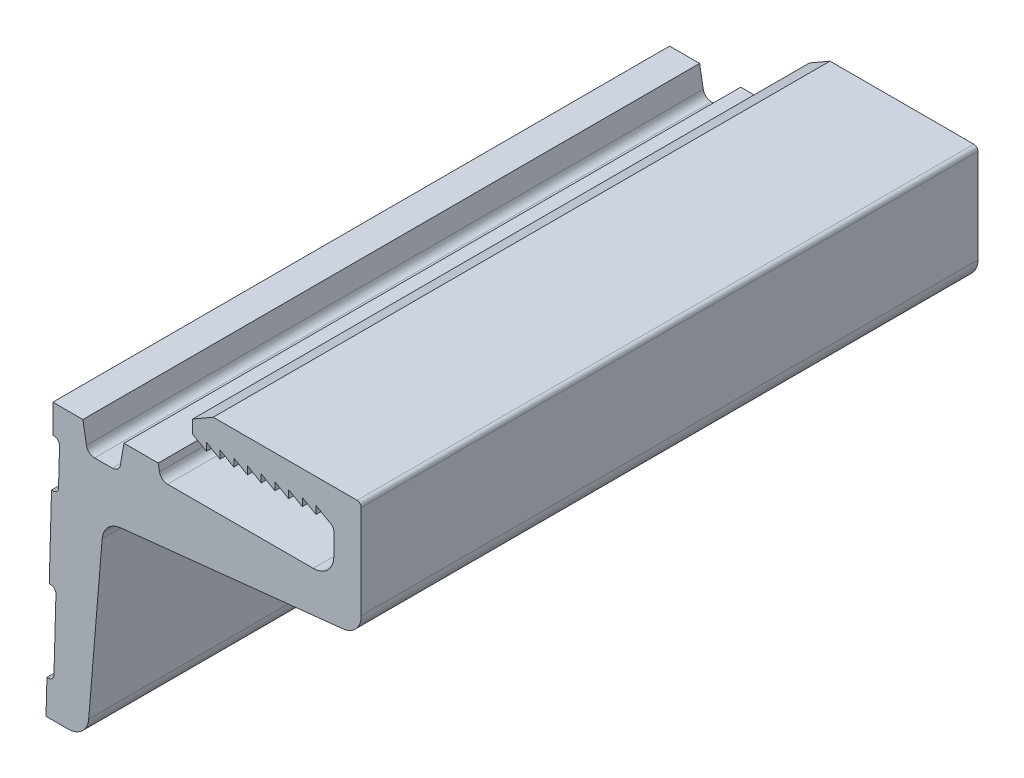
ISO-10303-21;
HEADER;
FILE_DESCRIPTION(('STEP AP214'),'2;1');
FILE_NAME('part.step','',(''),(''),'','','');
FILE_SCHEMA(('AUTOMOTIVE_DESIGN { 1 0 10303 214 1 1 1 1 }'));
ENDSEC;
DATA;
#1=APPLICATION_CONTEXT('core data for automotive mechanical design processes');
#2=APPLICATION_PROTOCOL_DEFINITION('international standard','automotive_design',2000,#1);
#3=PRODUCT_CONTEXT('',#1,'mechanical');
#4=PRODUCT('Part','Part','',(#3));
#5=PRODUCT_RELATED_PRODUCT_CATEGORY('part','',(#4));
#6=PRODUCT_DEFINITION_FORMATION('','',#4);
#7=PRODUCT_DEFINITION_CONTEXT('part definition',#1,'design');
#8=PRODUCT_DEFINITION('design','',#6,#7);
#9=PRODUCT_DEFINITION_SHAPE('','',#8);
#10=(LENGTH_UNIT() NAMED_UNIT(*) SI_UNIT(.MILLI.,.METRE.));
#11=(NAMED_UNIT(*) PLANE_ANGLE_UNIT() SI_UNIT($,.RADIAN.));
#12=(NAMED_UNIT(*) SI_UNIT($,.STERADIAN.) SOLID_ANGLE_UNIT());
#13=UNCERTAINTY_MEASURE_WITH_UNIT(LENGTH_MEASURE(1.E-05),#10,'distance_accuracy_value','');
#14=(GEOMETRIC_REPRESENTATION_CONTEXT(3) GLOBAL_UNCERTAINTY_ASSIGNED_CONTEXT((#13)) GLOBAL_UNIT_ASSIGNED_CONTEXT((#10,
#11,#12)) REPRESENTATION_CONTEXT('',''));
#15=CARTESIAN_POINT('',(0.,0.,0.));
#16=DIRECTION('',(0.,0.,1.));
#17=DIRECTION('',(1.,0.,0.));
#18=AXIS2_PLACEMENT_3D('',#15,#16,#17);
#19=CARTESIAN_POINT('',(6.83023135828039,4.07735576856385,0.));
#20=DIRECTION('',(1.,0.,0.));
#21=DIRECTION('',(0.,0.,-1.));
#22=AXIS2_PLACEMENT_3D('',#19,#20,#21);
#23=PLANE('',#22);
#24=DIRECTION('',(0.,1.,0.));
#25=VECTOR('',#24,1.);
#26=CARTESIAN_POINT('',(6.83023135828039,4.07735576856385,0.));
#27=LINE('',#26,#25);
#28=CARTESIAN_POINT('',(6.83023135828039,3.5,0.));
#29=VERTEX_POINT('',#28);
#30=CARTESIAN_POINT('',(6.83023135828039,4.07735576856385,0.));
#31=VERTEX_POINT('',#30);
#32=EDGE_CURVE('E430',#29,#31,#27,.T.);
#33=ORIENTED_EDGE('',*,*,#32,.T.);
#34=DIRECTION('',(0.,0.,1.));
#35=VECTOR('',#34,1.);
#36=CARTESIAN_POINT('',(6.83023135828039,4.07735576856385,0.));
#37=LINE('',#36,#35);
#38=CARTESIAN_POINT('',(6.83023135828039,4.07735576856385,45.));
#39=VERTEX_POINT('',#38);
#40=EDGE_CURVE('E417',#39,#31,#37,.F.);
#41=ORIENTED_EDGE('',*,*,#40,.F.);
#42=DIRECTION('',(0.,1.,0.));
#43=VECTOR('',#42,1.);
#44=CARTESIAN_POINT('',(6.83023135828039,4.07735576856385,45.));
#45=LINE('',#44,#43);
#46=CARTESIAN_POINT('',(6.83023135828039,3.5,45.));
#47=VERTEX_POINT('',#46);
#48=EDGE_CURVE('E435',#39,#47,#45,.F.);
#49=ORIENTED_EDGE('',*,*,#48,.T.);
#50=DIRECTION('',(0.,0.,1.));
#51=VECTOR('',#50,1.);
#52=CARTESIAN_POINT('',(6.83023135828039,3.5,0.));
#53=LINE('',#52,#51);
#54=EDGE_CURVE('E421',#29,#47,#53,.T.);
#55=ORIENTED_EDGE('',*,*,#54,.F.);
#56=EDGE_LOOP('',(#33,#41,#49,#55));
#57=FACE_BOUND('',#56,.T.);
#58=ADVANCED_FACE('F15',(#57),#23,.T.);
#59=CARTESIAN_POINT('',(6.83023135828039,3.5,0.));
#60=DIRECTION('',(-0.500003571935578,-0.86602334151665,0.));
#61=DIRECTION('',(0.86602334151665,-0.500003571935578,0.));
#62=AXIS2_PLACEMENT_3D('',#59,#60,#61);
#63=PLANE('',#62);
#64=DIRECTION('',(0.86602334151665,-0.500003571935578,0.));
#65=VECTOR('',#64,1.);
#66=CARTESIAN_POINT('',(6.83023135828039,3.5,0.));
#67=LINE('',#66,#65);
#68=CARTESIAN_POINT('',(5.83023135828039,4.07735576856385,0.));
#69=VERTEX_POINT('',#68);
#70=EDGE_CURVE('E424',#69,#29,#67,.T.);
#71=ORIENTED_EDGE('',*,*,#70,.T.);
#72=ORIENTED_EDGE('',*,*,#54,.T.);
#73=DIRECTION('',(0.86602334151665,-0.500003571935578,0.));
#74=VECTOR('',#73,1.);
#75=CARTESIAN_POINT('',(6.83023135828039,3.5,45.));
#76=LINE('',#75,#74);
#77=CARTESIAN_POINT('',(5.83023135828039,4.07735576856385,45.));
#78=VERTEX_POINT('',#77);
#79=EDGE_CURVE('E427',#47,#78,#76,.F.);
#80=ORIENTED_EDGE('',*,*,#79,.T.);
#81=DIRECTION('',(0.,0.,-1.));
#82=VECTOR('',#81,1.);
#83=CARTESIAN_POINT('',(5.83023135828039,4.07735576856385,0.));
#84=LINE('',#83,#82);
#85=EDGE_CURVE('E403',#69,#78,#84,.F.);
#86=ORIENTED_EDGE('',*,*,#85,.F.);
#87=EDGE_LOOP('',(#71,#72,#80,#86));
#88=FACE_BOUND('',#87,.T.);
#89=ADVANCED_FACE('F805',(#88),#63,.T.);
#90=CARTESIAN_POINT('',(7.8302313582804,3.5,0.));
#91=DIRECTION('',(-0.500003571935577,-0.86602334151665,0.));
#92=DIRECTION('',(0.86602334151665,-0.500003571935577,0.));
#93=AXIS2_PLACEMENT_3D('',#90,#91,#92);
#94=PLANE('',#93);
#95=DIRECTION('',(0.86602334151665,-0.500003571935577,0.));
#96=VECTOR('',#95,1.);
#97=CARTESIAN_POINT('',(7.8302313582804,3.5,0.));
#98=LINE('',#97,#96);
#99=CARTESIAN_POINT('',(7.8302313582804,3.5,0.));
#100=VERTEX_POINT('',#99);
#101=EDGE_CURVE('E412',#31,#100,#98,.T.);
#102=ORIENTED_EDGE('',*,*,#101,.T.);
#103=DIRECTION('',(0.,0.,-1.));
#104=VECTOR('',#103,1.);
#105=CARTESIAN_POINT('',(7.8302313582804,3.5,0.));
#106=LINE('',#105,#104);
#107=CARTESIAN_POINT('',(7.8302313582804,3.5,45.));
#108=VERTEX_POINT('',#107);
#109=EDGE_CURVE('E399',#108,#100,#106,.T.);
#110=ORIENTED_EDGE('',*,*,#109,.F.);
#111=DIRECTION('',(0.86602334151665,-0.500003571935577,0.));
#112=VECTOR('',#111,1.);
#113=CARTESIAN_POINT('',(7.8302313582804,3.5,45.));
#114=LINE('',#113,#112);
#115=EDGE_CURVE('E418',#108,#39,#114,.F.);
#116=ORIENTED_EDGE('',*,*,#115,.T.);
#117=ORIENTED_EDGE('',*,*,#40,.T.);
#118=EDGE_LOOP('',(#102,#110,#116,#117));
#119=FACE_BOUND('',#118,.T.);
#120=ADVANCED_FACE('F812',(#119),#94,.T.);
#121=CARTESIAN_POINT('',(5.83023135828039,4.07735576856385,0.));
#122=DIRECTION('',(1.,0.,0.));
#123=DIRECTION('',(0.,0.,-1.));
#124=AXIS2_PLACEMENT_3D('',#121,#122,#123);
#125=PLANE('',#124);
#126=DIRECTION('',(0.,1.,0.));
#127=VECTOR('',#126,1.);
#128=CARTESIAN_POINT('',(5.83023135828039,4.07735576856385,0.));
#129=LINE('',#128,#127);
#130=CARTESIAN_POINT('',(5.83023135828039,3.5,0.));
#131=VERTEX_POINT('',#130);
#132=EDGE_CURVE('E406',#131,#69,#129,.T.);
#133=ORIENTED_EDGE('',*,*,#132,.T.);
#134=ORIENTED_EDGE('',*,*,#85,.T.);
#135=DIRECTION('',(0.,1.,0.));
#136=VECTOR('',#135,1.);
#137=CARTESIAN_POINT('',(5.83023135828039,4.07735576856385,45.));
#138=LINE('',#137,#136);
#139=CARTESIAN_POINT('',(5.83023135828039,3.5,45.));
#140=VERTEX_POINT('',#139);
#141=EDGE_CURVE('E409',#78,#140,#138,.F.);
#142=ORIENTED_EDGE('',*,*,#141,.T.);
#143=DIRECTION('',(0.,0.,1.));
#144=VECTOR('',#143,1.);
#145=CARTESIAN_POINT('',(5.83023135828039,3.5,0.));
#146=LINE('',#145,#144);
#147=EDGE_CURVE('E385',#131,#140,#146,.T.);
#148=ORIENTED_EDGE('',*,*,#147,.F.);
#149=EDGE_LOOP('',(#133,#134,#142,#148));
#150=FACE_BOUND('',#149,.T.);
#151=ADVANCED_FACE('F1297',(#150),#125,.T.);
#152=CARTESIAN_POINT('',(7.8302313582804,4.07735576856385,0.));
#153=DIRECTION('',(1.,0.,0.));
#154=DIRECTION('',(0.,0.,-1.));
#155=AXIS2_PLACEMENT_3D('',#152,#153,#154);
#156=PLANE('',#155);
#157=DIRECTION('',(0.,1.,0.));
#158=VECTOR('',#157,1.);
#159=CARTESIAN_POINT('',(7.8302313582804,4.07735576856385,0.));
#160=LINE('',#159,#158);
#161=CARTESIAN_POINT('',(7.8302313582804,4.07735576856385,0.));
#162=VERTEX_POINT('',#161);
#163=EDGE_CURVE('E394',#100,#162,#160,.T.);
#164=ORIENTED_EDGE('',*,*,#163,.T.);
#165=DIRECTION('',(0.,0.,1.));
#166=VECTOR('',#165,1.);
#167=CARTESIAN_POINT('',(7.8302313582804,4.07735576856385,0.));
#168=LINE('',#167,#166);
#169=CARTESIAN_POINT('',(7.8302313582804,4.07735576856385,45.));
#170=VERTEX_POINT('',#169);
#171=EDGE_CURVE('E381',#170,#162,#168,.F.);
#172=ORIENTED_EDGE('',*,*,#171,.F.);
#173=DIRECTION('',(0.,1.,0.));
#174=VECTOR('',#173,1.);
#175=CARTESIAN_POINT('',(7.8302313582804,4.07735576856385,45.));
#176=LINE('',#175,#174);
#177=EDGE_CURVE('E400',#170,#108,#176,.F.);
#178=ORIENTED_EDGE('',*,*,#177,.T.);
#179=ORIENTED_EDGE('',*,*,#109,.T.);
#180=EDGE_LOOP('',(#164,#172,#178,#179));
#181=FACE_BOUND('',#180,.T.);
#182=ADVANCED_FACE('F816',(#181),#156,.T.);
#183=CARTESIAN_POINT('',(5.83023135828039,3.5,0.));
#184=DIRECTION('',(-0.500003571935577,-0.86602334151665,0.));
#185=DIRECTION('',(0.86602334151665,-0.500003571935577,0.));
#186=AXIS2_PLACEMENT_3D('',#183,#184,#185);
#187=PLANE('',#186);
#188=DIRECTION('',(0.86602334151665,-0.500003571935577,0.));
#189=VECTOR('',#188,1.);
#190=CARTESIAN_POINT('',(5.83023135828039,3.5,0.));
#191=LINE('',#190,#189);
#192=CARTESIAN_POINT('',(4.83023135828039,4.07735576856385,0.));
#193=VERTEX_POINT('',#192);
#194=EDGE_CURVE('E388',#193,#131,#191,.T.);
#195=ORIENTED_EDGE('',*,*,#194,.T.);
#196=ORIENTED_EDGE('',*,*,#147,.T.);
#197=DIRECTION('',(0.86602334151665,-0.500003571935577,0.));
#198=VECTOR('',#197,1.);
#199=CARTESIAN_POINT('',(5.83023135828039,3.5,45.));
#200=LINE('',#199,#198);
#201=CARTESIAN_POINT('',(4.83023135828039,4.07735576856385,45.));
#202=VERTEX_POINT('',#201);
#203=EDGE_CURVE('E391',#140,#202,#200,.F.);
#204=ORIENTED_EDGE('',*,*,#203,.T.);
#205=DIRECTION('',(0.,0.,-1.));
#206=VECTOR('',#205,1.);
#207=CARTESIAN_POINT('',(4.83023135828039,4.07735576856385,0.));
#208=LINE('',#207,#206);
#209=EDGE_CURVE('E367',#193,#202,#208,.F.);
#210=ORIENTED_EDGE('',*,*,#209,.F.);
#211=EDGE_LOOP('',(#195,#196,#204,#210));
#212=FACE_BOUND('',#211,.T.);
#213=ADVANCED_FACE('F1283',(#212),#187,.T.);
#214=CARTESIAN_POINT('',(8.8302313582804,3.5,0.));
#215=DIRECTION('',(-0.500003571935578,-0.86602334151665,0.));
#216=DIRECTION('',(0.86602334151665,-0.500003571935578,0.));
#217=AXIS2_PLACEMENT_3D('',#214,#215,#216);
#218=PLANE('',#217);
#219=DIRECTION('',(0.86602334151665,-0.500003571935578,0.));
#220=VECTOR('',#219,1.);
#221=CARTESIAN_POINT('',(8.8302313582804,3.5,0.));
#222=LINE('',#221,#220);
#223=CARTESIAN_POINT('',(8.8302313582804,3.5,0.));
#224=VERTEX_POINT('',#223);
#225=EDGE_CURVE('E376',#162,#224,#222,.T.);
#226=ORIENTED_EDGE('',*,*,#225,.T.);
#227=DIRECTION('',(0.,0.,-1.));
#228=VECTOR('',#227,1.);
#229=CARTESIAN_POINT('',(8.8302313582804,3.5,0.));
#230=LINE('',#229,#228);
#231=CARTESIAN_POINT('',(8.8302313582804,3.5,45.));
#232=VERTEX_POINT('',#231);
#233=EDGE_CURVE('E363',#232,#224,#230,.T.);
#234=ORIENTED_EDGE('',*,*,#233,.F.);
#235=DIRECTION('',(0.86602334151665,-0.500003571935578,0.));
#236=VECTOR('',#235,1.);
#237=CARTESIAN_POINT('',(8.8302313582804,3.5,45.));
#238=LINE('',#237,#236);
#239=EDGE_CURVE('E382',#232,#170,#238,.F.);
#240=ORIENTED_EDGE('',*,*,#239,.T.);
#241=ORIENTED_EDGE('',*,*,#171,.T.);
#242=EDGE_LOOP('',(#226,#234,#240,#241));
#243=FACE_BOUND('',#242,.T.);
#244=ADVANCED_FACE('F818',(#243),#218,.T.);
#245=CARTESIAN_POINT('',(4.83023135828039,4.07735576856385,0.));
#246=DIRECTION('',(1.,0.,0.));
#247=DIRECTION('',(0.,0.,-1.));
#248=AXIS2_PLACEMENT_3D('',#245,#246,#247);
#249=PLANE('',#248);
#250=DIRECTION('',(0.,1.,0.));
#251=VECTOR('',#250,1.);
#252=CARTESIAN_POINT('',(4.83023135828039,4.07735576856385,0.));
#253=LINE('',#252,#251);
#254=CARTESIAN_POINT('',(4.83023135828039,3.5,0.));
#255=VERTEX_POINT('',#254);
#256=EDGE_CURVE('E370',#255,#193,#253,.T.);
#257=ORIENTED_EDGE('',*,*,#256,.T.);
#258=ORIENTED_EDGE('',*,*,#209,.T.);
#259=DIRECTION('',(0.,1.,0.));
#260=VECTOR('',#259,1.);
#261=CARTESIAN_POINT('',(4.83023135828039,4.07735576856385,45.));
#262=LINE('',#261,#260);
#263=CARTESIAN_POINT('',(4.83023135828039,3.5,45.));
#264=VERTEX_POINT('',#263);
#265=EDGE_CURVE('E373',#202,#264,#262,.F.);
#266=ORIENTED_EDGE('',*,*,#265,.T.);
#267=DIRECTION('',(0.,0.,1.));
#268=VECTOR('',#267,1.);
#269=CARTESIAN_POINT('',(4.83023135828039,3.5,0.));
#270=LINE('',#269,#268);
#271=EDGE_CURVE('E349',#255,#264,#270,.T.);
#272=ORIENTED_EDGE('',*,*,#271,.F.);
#273=EDGE_LOOP('',(#257,#258,#266,#272));
#274=FACE_BOUND('',#273,.T.);
#275=ADVANCED_FACE('F1269',(#274),#249,.T.);
#276=CARTESIAN_POINT('',(8.8302313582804,4.07735576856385,0.));
#277=DIRECTION('',(1.,0.,0.));
#278=DIRECTION('',(0.,0.,-1.));
#279=AXIS2_PLACEMENT_3D('',#276,#277,#278);
#280=PLANE('',#279);
#281=DIRECTION('',(0.,1.,0.));
#282=VECTOR('',#281,1.);
#283=CARTESIAN_POINT('',(8.8302313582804,4.07735576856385,0.));
#284=LINE('',#283,#282);
#285=CARTESIAN_POINT('',(8.8302313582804,4.07735576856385,0.));
#286=VERTEX_POINT('',#285);
#287=EDGE_CURVE('E358',#224,#286,#284,.T.);
#288=ORIENTED_EDGE('',*,*,#287,.T.);
#289=DIRECTION('',(0.,0.,1.));
#290=VECTOR('',#289,1.);
#291=CARTESIAN_POINT('',(8.8302313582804,4.07735576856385,0.));
#292=LINE('',#291,#290);
#293=CARTESIAN_POINT('',(8.8302313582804,4.07735576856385,45.));
#294=VERTEX_POINT('',#293);
#295=EDGE_CURVE('E345',#294,#286,#292,.F.);
#296=ORIENTED_EDGE('',*,*,#295,.F.);
#297=DIRECTION('',(0.,1.,0.));
#298=VECTOR('',#297,1.);
#299=CARTESIAN_POINT('',(8.8302313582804,4.07735576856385,45.));
#300=LINE('',#299,#298);
#301=EDGE_CURVE('E364',#294,#232,#300,.F.);
#302=ORIENTED_EDGE('',*,*,#301,.T.);
#303=ORIENTED_EDGE('',*,*,#233,.T.);
#304=EDGE_LOOP('',(#288,#296,#302,#303));
#305=FACE_BOUND('',#304,.T.);
#306=ADVANCED_FACE('F822',(#305),#280,.T.);
#307=CARTESIAN_POINT('',(4.83023135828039,3.5,0.));
#308=DIRECTION('',(-0.500003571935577,-0.86602334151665,0.));
#309=DIRECTION('',(0.86602334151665,-0.500003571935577,0.));
#310=AXIS2_PLACEMENT_3D('',#307,#308,#309);
#311=PLANE('',#310);
#312=DIRECTION('',(0.86602334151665,-0.500003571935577,0.));
#313=VECTOR('',#312,1.);
#314=CARTESIAN_POINT('',(4.83023135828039,3.5,0.));
#315=LINE('',#314,#313);
#316=CARTESIAN_POINT('',(3.83023135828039,4.07735576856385,0.));
#317=VERTEX_POINT('',#316);
#318=EDGE_CURVE('E352',#317,#255,#315,.T.);
#319=ORIENTED_EDGE('',*,*,#318,.T.);
#320=ORIENTED_EDGE('',*,*,#271,.T.);
#321=DIRECTION('',(0.86602334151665,-0.500003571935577,0.));
#322=VECTOR('',#321,1.);
#323=CARTESIAN_POINT('',(4.83023135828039,3.5,45.));
#324=LINE('',#323,#322);
#325=CARTESIAN_POINT('',(3.83023135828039,4.07735576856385,45.));
#326=VERTEX_POINT('',#325);
#327=EDGE_CURVE('E355',#264,#326,#324,.F.);
#328=ORIENTED_EDGE('',*,*,#327,.T.);
#329=DIRECTION('',(0.,0.,-1.));
#330=VECTOR('',#329,1.);
#331=CARTESIAN_POINT('',(3.83023135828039,4.07735576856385,0.));
#332=LINE('',#331,#330);
#333=EDGE_CURVE('E331',#317,#326,#332,.F.);
#334=ORIENTED_EDGE('',*,*,#333,.F.);
#335=EDGE_LOOP('',(#319,#320,#328,#334));
#336=FACE_BOUND('',#335,.T.);
#337=ADVANCED_FACE('F1255',(#336),#311,.T.);
#338=CARTESIAN_POINT('',(9.83023135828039,3.5,0.));
#339=DIRECTION('',(-0.500003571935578,-0.866023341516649,0.));
#340=DIRECTION('',(0.866023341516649,-0.500003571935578,0.));
#341=AXIS2_PLACEMENT_3D('',#338,#339,#340);
#342=PLANE('',#341);
#343=DIRECTION('',(0.866023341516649,-0.500003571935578,0.));
#344=VECTOR('',#343,1.);
#345=CARTESIAN_POINT('',(9.83023135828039,3.5,0.));
#346=LINE('',#345,#344);
#347=CARTESIAN_POINT('',(9.83023135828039,3.5,0.));
#348=VERTEX_POINT('',#347);
#349=EDGE_CURVE('E340',#286,#348,#346,.T.);
#350=ORIENTED_EDGE('',*,*,#349,.T.);
#351=DIRECTION('',(0.,0.,-1.));
#352=VECTOR('',#351,1.);
#353=CARTESIAN_POINT('',(9.83023135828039,3.5,0.));
#354=LINE('',#353,#352);
#355=CARTESIAN_POINT('',(9.83023135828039,3.5,45.));
#356=VERTEX_POINT('',#355);
#357=EDGE_CURVE('E327',#356,#348,#354,.T.);
#358=ORIENTED_EDGE('',*,*,#357,.F.);
#359=DIRECTION('',(0.866023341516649,-0.500003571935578,0.));
#360=VECTOR('',#359,1.);
#361=CARTESIAN_POINT('',(9.83023135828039,3.5,45.));
#362=LINE('',#361,#360);
#363=EDGE_CURVE('E346',#356,#294,#362,.F.);
#364=ORIENTED_EDGE('',*,*,#363,.T.);
#365=ORIENTED_EDGE('',*,*,#295,.T.);
#366=EDGE_LOOP('',(#350,#358,#364,#365));
#367=FACE_BOUND('',#366,.T.);
#368=ADVANCED_FACE('F826',(#367),#342,.T.);
#369=CARTESIAN_POINT('',(3.83023135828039,4.07735576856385,0.));
#370=DIRECTION('',(1.,0.,0.));
#371=DIRECTION('',(0.,0.,-1.));
#372=AXIS2_PLACEMENT_3D('',#369,#370,#371);
#373=PLANE('',#372);
#374=DIRECTION('',(0.,1.,0.));
#375=VECTOR('',#374,1.);
#376=CARTESIAN_POINT('',(3.83023135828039,4.07735576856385,0.));
#377=LINE('',#376,#375);
#378=CARTESIAN_POINT('',(3.83023135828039,3.5,0.));
#379=VERTEX_POINT('',#378);
#380=EDGE_CURVE('E334',#379,#317,#377,.T.);
#381=ORIENTED_EDGE('',*,*,#380,.T.);
#382=ORIENTED_EDGE('',*,*,#333,.T.);
#383=DIRECTION('',(0.,1.,0.));
#384=VECTOR('',#383,1.);
#385=CARTESIAN_POINT('',(3.83023135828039,4.07735576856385,45.));
#386=LINE('',#385,#384);
#387=CARTESIAN_POINT('',(3.83023135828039,3.5,45.));
#388=VERTEX_POINT('',#387);
#389=EDGE_CURVE('E337',#326,#388,#386,.F.);
#390=ORIENTED_EDGE('',*,*,#389,.T.);
#391=DIRECTION('',(0.,0.,1.));
#392=VECTOR('',#391,1.);
#393=CARTESIAN_POINT('',(3.83023135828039,3.5,0.));
#394=LINE('',#393,#392);
#395=EDGE_CURVE('E313',#379,#388,#394,.T.);
#396=ORIENTED_EDGE('',*,*,#395,.F.);
#397=EDGE_LOOP('',(#381,#382,#390,#396));
#398=FACE_BOUND('',#397,.T.);
#399=ADVANCED_FACE('F1241',(#398),#373,.T.);
#400=CARTESIAN_POINT('',(9.83023135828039,4.07735576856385,0.));
#401=DIRECTION('',(1.,0.,0.));
#402=DIRECTION('',(0.,0.,-1.));
#403=AXIS2_PLACEMENT_3D('',#400,#401,#402);
#404=PLANE('',#403);
#405=DIRECTION('',(0.,1.,0.));
#406=VECTOR('',#405,1.);
#407=CARTESIAN_POINT('',(9.83023135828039,4.07735576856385,0.));
#408=LINE('',#407,#406);
#409=CARTESIAN_POINT('',(9.83023135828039,4.07735576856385,0.));
#410=VERTEX_POINT('',#409);
#411=EDGE_CURVE('E322',#348,#410,#408,.T.);
#412=ORIENTED_EDGE('',*,*,#411,.T.);
#413=DIRECTION('',(0.,0.,1.));
#414=VECTOR('',#413,1.);
#415=CARTESIAN_POINT('',(9.83023135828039,4.07735576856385,0.));
#416=LINE('',#415,#414);
#417=CARTESIAN_POINT('',(9.83023135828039,4.07735576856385,45.));
#418=VERTEX_POINT('',#417);
#419=EDGE_CURVE('E309',#418,#410,#416,.F.);
#420=ORIENTED_EDGE('',*,*,#419,.F.);
#421=DIRECTION('',(0.,1.,0.));
#422=VECTOR('',#421,1.);
#423=CARTESIAN_POINT('',(9.83023135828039,4.07735576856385,45.));
#424=LINE('',#423,#422);
#425=EDGE_CURVE('E328',#418,#356,#424,.F.);
#426=ORIENTED_EDGE('',*,*,#425,.T.);
#427=ORIENTED_EDGE('',*,*,#357,.T.);
#428=EDGE_LOOP('',(#412,#420,#426,#427));
#429=FACE_BOUND('',#428,.T.);
#430=ADVANCED_FACE('F830',(#429),#404,.T.);
#431=CARTESIAN_POINT('',(3.83023135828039,3.5,0.));
#432=DIRECTION('',(-0.500003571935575,-0.866023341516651,0.));
#433=DIRECTION('',(0.866023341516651,-0.500003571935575,0.));
#434=AXIS2_PLACEMENT_3D('',#431,#432,#433);
#435=PLANE('',#434);
#436=DIRECTION('',(0.866023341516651,-0.500003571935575,0.));
#437=VECTOR('',#436,1.);
#438=CARTESIAN_POINT('',(3.83023135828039,3.5,0.));
#439=LINE('',#438,#437);
#440=CARTESIAN_POINT('',(2.8302313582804,4.07735576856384,0.));
#441=VERTEX_POINT('',#440);
#442=EDGE_CURVE('E316',#441,#379,#439,.T.);
#443=ORIENTED_EDGE('',*,*,#442,.T.);
#444=ORIENTED_EDGE('',*,*,#395,.T.);
#445=DIRECTION('',(0.866023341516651,-0.500003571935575,0.));
#446=VECTOR('',#445,1.);
#447=CARTESIAN_POINT('',(3.83023135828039,3.5,45.));
#448=LINE('',#447,#446);
#449=CARTESIAN_POINT('',(2.8302313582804,4.07735576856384,45.));
#450=VERTEX_POINT('',#449);
#451=EDGE_CURVE('E319',#388,#450,#448,.F.);
#452=ORIENTED_EDGE('',*,*,#451,.T.);
#453=DIRECTION('',(0.,0.,-1.));
#454=VECTOR('',#453,1.);
#455=CARTESIAN_POINT('',(2.8302313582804,4.07735576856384,0.));
#456=LINE('',#455,#454);
#457=EDGE_CURVE('E295',#441,#450,#456,.F.);
#458=ORIENTED_EDGE('',*,*,#457,.F.);
#459=EDGE_LOOP('',(#443,#444,#452,#458));
#460=FACE_BOUND('',#459,.T.);
#461=ADVANCED_FACE('F1227',(#460),#435,.T.);
#462=CARTESIAN_POINT('',(10.8302313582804,3.5,0.));
#463=DIRECTION('',(-0.500003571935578,-0.86602334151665,0.));
#464=DIRECTION('',(0.86602334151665,-0.500003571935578,0.));
#465=AXIS2_PLACEMENT_3D('',#462,#463,#464);
#466=PLANE('',#465);
#467=DIRECTION('',(0.86602334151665,-0.500003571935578,0.));
#468=VECTOR('',#467,1.);
#469=CARTESIAN_POINT('',(10.8302313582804,3.5,0.));
#470=LINE('',#469,#468);
#471=CARTESIAN_POINT('',(10.8302313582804,3.5,0.));
#472=VERTEX_POINT('',#471);
#473=EDGE_CURVE('E304',#410,#472,#470,.T.);
#474=ORIENTED_EDGE('',*,*,#473,.T.);
#475=DIRECTION('',(0.,0.,-1.));
#476=VECTOR('',#475,1.);
#477=CARTESIAN_POINT('',(10.8302313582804,3.5,0.));
#478=LINE('',#477,#476);
#479=CARTESIAN_POINT('',(10.8302313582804,3.5,45.));
#480=VERTEX_POINT('',#479);
#481=EDGE_CURVE('E291',#480,#472,#478,.T.);
#482=ORIENTED_EDGE('',*,*,#481,.F.);
#483=DIRECTION('',(0.86602334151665,-0.500003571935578,0.));
#484=VECTOR('',#483,1.);
#485=CARTESIAN_POINT('',(10.8302313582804,3.5,45.));
#486=LINE('',#485,#484);
#487=EDGE_CURVE('E310',#480,#418,#486,.F.);
#488=ORIENTED_EDGE('',*,*,#487,.T.);
#489=ORIENTED_EDGE('',*,*,#419,.T.);
#490=EDGE_LOOP('',(#474,#482,#488,#489));
#491=FACE_BOUND('',#490,.T.);
#492=ADVANCED_FACE('F834',(#491),#466,.T.);
#493=CARTESIAN_POINT('',(2.8302313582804,4.07735576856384,0.));
#494=DIRECTION('',(1.,0.,0.));
#495=DIRECTION('',(0.,0.,-1.));
#496=AXIS2_PLACEMENT_3D('',#493,#494,#495);
#497=PLANE('',#496);
#498=DIRECTION('',(0.,1.,0.));
#499=VECTOR('',#498,1.);
#500=CARTESIAN_POINT('',(2.8302313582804,4.07735576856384,0.));
#501=LINE('',#500,#499);
#502=CARTESIAN_POINT('',(2.8302313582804,3.5,0.));
#503=VERTEX_POINT('',#502);
#504=EDGE_CURVE('E298',#503,#441,#501,.T.);
#505=ORIENTED_EDGE('',*,*,#504,.T.);
#506=ORIENTED_EDGE('',*,*,#457,.T.);
#507=DIRECTION('',(0.,1.,0.));
#508=VECTOR('',#507,1.);
#509=CARTESIAN_POINT('',(2.8302313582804,4.07735576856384,45.));
#510=LINE('',#509,#508);
#511=CARTESIAN_POINT('',(2.8302313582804,3.5,45.));
#512=VERTEX_POINT('',#511);
#513=EDGE_CURVE('E301',#450,#512,#510,.F.);
#514=ORIENTED_EDGE('',*,*,#513,.T.);
#515=DIRECTION('',(0.,0.,1.));
#516=VECTOR('',#515,1.);
#517=CARTESIAN_POINT('',(2.8302313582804,3.5,0.));
#518=LINE('',#517,#516);
#519=EDGE_CURVE('E271',#503,#512,#518,.T.);
#520=ORIENTED_EDGE('',*,*,#519,.F.);
#521=EDGE_LOOP('',(#505,#506,#514,#520));
#522=FACE_BOUND('',#521,.T.);
#523=ADVANCED_FACE('F1213',(#522),#497,.T.);
#524=CARTESIAN_POINT('',(10.8302313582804,4.07734680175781,0.));
#525=DIRECTION('',(1.,0.,0.));
#526=DIRECTION('',(0.,0.,-1.));
#527=AXIS2_PLACEMENT_3D('',#524,#525,#526);
#528=PLANE('',#527);
#529=DIRECTION('',(0.,1.,0.));
#530=VECTOR('',#529,1.);
#531=CARTESIAN_POINT('',(10.8302313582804,4.07734680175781,0.));
#532=LINE('',#531,#530);
#533=CARTESIAN_POINT('',(10.8302313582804,4.07734680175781,0.));
#534=VERTEX_POINT('',#533);
#535=EDGE_CURVE('E284',#472,#534,#532,.T.);
#536=ORIENTED_EDGE('',*,*,#535,.T.);
#537=DIRECTION('',(0.,0.,1.));
#538=VECTOR('',#537,1.);
#539=CARTESIAN_POINT('',(10.8302313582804,4.07734680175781,0.));
#540=LINE('',#539,#538);
#541=CARTESIAN_POINT('',(10.8302313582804,4.07734680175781,45.));
#542=VERTEX_POINT('',#541);
#543=EDGE_CURVE('E270',#542,#534,#540,.F.);
#544=ORIENTED_EDGE('',*,*,#543,.F.);
#545=DIRECTION('',(0.,1.,0.));
#546=VECTOR('',#545,1.);
#547=CARTESIAN_POINT('',(10.8302313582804,4.07734680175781,45.));
#548=LINE('',#547,#546);
#549=EDGE_CURVE('E292',#542,#480,#548,.F.);
#550=ORIENTED_EDGE('',*,*,#549,.T.);
#551=ORIENTED_EDGE('',*,*,#481,.T.);
#552=EDGE_LOOP('',(#536,#544,#550,#551));
#553=FACE_BOUND('',#552,.T.);
#554=ADVANCED_FACE('F837',(#553),#528,.T.);
#555=CARTESIAN_POINT('',(2.8302313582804,3.5,0.));
#556=DIRECTION('',(-0.500003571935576,-0.86602334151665,0.));
#557=DIRECTION('',(0.86602334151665,-0.500003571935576,0.));
#558=AXIS2_PLACEMENT_3D('',#555,#556,#557);
#559=PLANE('',#558);
#560=DIRECTION('',(0.86602334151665,-0.500003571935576,0.));
#561=VECTOR('',#560,1.);
#562=CARTESIAN_POINT('',(2.8302313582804,3.5,0.));
#563=LINE('',#562,#561);
#564=CARTESIAN_POINT('',(1.8302313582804,4.07735576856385,0.));
#565=VERTEX_POINT('',#564);
#566=EDGE_CURVE('E278',#565,#503,#563,.T.);
#567=ORIENTED_EDGE('',*,*,#566,.T.);
#568=ORIENTED_EDGE('',*,*,#519,.T.);
#569=DIRECTION('',(0.86602334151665,-0.500003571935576,0.));
#570=VECTOR('',#569,1.);
#571=CARTESIAN_POINT('',(2.8302313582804,3.5,45.));
#572=LINE('',#571,#570);
#573=CARTESIAN_POINT('',(1.8302313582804,4.07735576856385,45.));
#574=VERTEX_POINT('',#573);
#575=EDGE_CURVE('E281',#512,#574,#572,.F.);
#576=ORIENTED_EDGE('',*,*,#575,.T.);
#577=DIRECTION('',(0.,0.,1.));
#578=VECTOR('',#577,1.);
#579=CARTESIAN_POINT('',(1.8302313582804,4.07735576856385,0.));
#580=LINE('',#579,#578);
#581=EDGE_CURVE('E274',#565,#574,#580,.T.);
#582=ORIENTED_EDGE('',*,*,#581,.F.);
#583=EDGE_LOOP('',(#567,#568,#576,#582));
#584=FACE_BOUND('',#583,.T.);
#585=ADVANCED_FACE('F1199',(#584),#559,.T.);
#586=CARTESIAN_POINT('',(11.9302299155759,3.44225628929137,0.));
#587=DIRECTION('',(-0.500003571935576,-0.86602334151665,0.));
#588=DIRECTION('',(0.86602334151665,-0.500003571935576,0.));
#589=AXIS2_PLACEMENT_3D('',#586,#587,#588);
#590=PLANE('',#589);
#591=DIRECTION('',(0.86602334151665,-0.500003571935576,0.));
#592=VECTOR('',#591,1.);
#593=CARTESIAN_POINT('',(11.9302299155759,3.44225628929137,0.));
#594=LINE('',#593,#592);
#595=CARTESIAN_POINT('',(11.9302299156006,3.4422562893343,0.));
#596=VERTEX_POINT('',#595);
#597=EDGE_CURVE('E261',#534,#596,#594,.T.);
#598=ORIENTED_EDGE('',*,*,#597,.T.);
#599=DIRECTION('',(0.,0.,1.));
#600=VECTOR('',#599,1.);
#601=CARTESIAN_POINT('',(11.9302299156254,3.44225628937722,0.));
#602=LINE('',#601,#600);
#603=CARTESIAN_POINT('',(11.9302299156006,3.4422562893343,45.));
#604=VERTEX_POINT('',#603);
#605=EDGE_CURVE('E263',#596,#604,#602,.T.);
#606=ORIENTED_EDGE('',*,*,#605,.T.);
#607=DIRECTION('',(0.86602334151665,-0.500003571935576,0.));
#608=VECTOR('',#607,1.);
#609=CARTESIAN_POINT('',(11.9302299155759,3.44225628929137,45.));
#610=LINE('',#609,#608);
#611=EDGE_CURVE('E267',#604,#542,#610,.F.);
#612=ORIENTED_EDGE('',*,*,#611,.T.);
#613=ORIENTED_EDGE('',*,*,#543,.T.);
#614=EDGE_LOOP('',(#598,#606,#612,#613));
#615=FACE_BOUND('',#614,.T.);
#616=ADVANCED_FACE('F841',(#615),#590,.T.);
#617=CARTESIAN_POINT('',(-5.32367441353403,-1.,0.));
#618=DIRECTION('',(3.06326E-10,1.,0.));
#619=DIRECTION('',(-1.,3.06326E-10,0.));
#620=AXIS2_PLACEMENT_3D('',#617,#618,#619);
#621=PLANE('',#620);
#622=DIRECTION('',(-1.,3.06326E-10,0.));
#623=VECTOR('',#622,1.);
#624=CARTESIAN_POINT('',(-5.32367441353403,-1.,0.));
#625=LINE('',#624,#623);
#626=CARTESIAN_POINT('',(-4.03586714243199,-1.00000000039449,0.));
#627=VERTEX_POINT('',#626);
#628=CARTESIAN_POINT('',(-5.32367441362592,-1.00000000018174,0.));
#629=VERTEX_POINT('',#628);
#630=EDGE_CURVE('E220',#627,#629,#625,.T.);
#631=ORIENTED_EDGE('',*,*,#630,.T.);
#632=DIRECTION('',(0.,0.,1.));
#633=VECTOR('',#632,1.);
#634=CARTESIAN_POINT('',(-5.32367441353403,-1.00000000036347,0.));
#635=LINE('',#634,#633);
#636=CARTESIAN_POINT('',(-5.32367441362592,-1.00000000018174,45.));
#637=VERTEX_POINT('',#636);
#638=EDGE_CURVE('E218',#629,#637,#635,.T.);
#639=ORIENTED_EDGE('',*,*,#638,.T.);
#640=DIRECTION('',(-1.,3.06326E-10,0.));
#641=VECTOR('',#640,1.);
#642=CARTESIAN_POINT('',(-5.32367441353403,-1.,45.));
#643=LINE('',#642,#641);
#644=CARTESIAN_POINT('',(-4.03586714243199,-1.00000000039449,45.));
#645=VERTEX_POINT('',#644);
#646=EDGE_CURVE('E259',#637,#645,#643,.F.);
#647=ORIENTED_EDGE('',*,*,#646,.T.);
#648=DIRECTION('',(0.,0.,1.));
#649=VECTOR('',#648,1.);
#650=CARTESIAN_POINT('',(-4.0358671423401,-1.00000000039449,0.));
#651=LINE('',#650,#649);
#652=EDGE_CURVE('E254',#645,#627,#651,.F.);
#653=ORIENTED_EDGE('',*,*,#652,.T.);
#654=EDGE_LOOP('',(#631,#639,#647,#653));
#655=FACE_BOUND('',#654,.T.);
#656=ADVANCED_FACE('F1185',(#655),#621,.T.);
#657=CARTESIAN_POINT('',(-5.32367441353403,-0.400027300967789,0.));
#658=DIRECTION('',(0.,0.,1.));
#659=DIRECTION('',(1.,0.,0.));
#660=AXIS2_PLACEMENT_3D('',#657,#658,#659);
#661=CYLINDRICAL_SURFACE('',#660,0.599972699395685);
#662=ORIENTED_EDGE('',*,*,#638,.F.);
#663=CARTESIAN_POINT('',(-5.32367441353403,-0.400027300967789,0.));
#664=DIRECTION('',(0.,0.,1.));
#665=DIRECTION('',(1.,0.,0.));
#666=AXIS2_PLACEMENT_3D('',#663,#664,#665);
#667=CIRCLE('',#666,0.599972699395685);
#668=CARTESIAN_POINT('',(-5.91453232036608,-0.504210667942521,0.));
#669=VERTEX_POINT('',#668);
#670=EDGE_CURVE('E18',#669,#629,#667,.T.);
#671=ORIENTED_EDGE('',*,*,#670,.F.);
#672=DIRECTION('',(0.,0.,1.));
#673=VECTOR('',#672,1.);
#674=CARTESIAN_POINT('',(-5.91453232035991,-0.504210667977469,0.));
#675=LINE('',#674,#673);
#676=CARTESIAN_POINT('',(-5.91453232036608,-0.504210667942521,45.));
#677=VERTEX_POINT('',#676);
#678=EDGE_CURVE('E215',#677,#669,#675,.F.);
#679=ORIENTED_EDGE('',*,*,#678,.F.);
#680=CARTESIAN_POINT('',(-5.32367441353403,-0.400027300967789,45.));
#681=DIRECTION('',(0.,0.,1.));
#682=DIRECTION('',(1.,0.,0.));
#683=AXIS2_PLACEMENT_3D('',#680,#681,#682);
#684=CIRCLE('',#683,0.599972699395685);
#685=EDGE_CURVE('E286',#637,#677,#684,.F.);
#686=ORIENTED_EDGE('',*,*,#685,.F.);
#687=EDGE_LOOP('',(#662,#671,#679,#686));
#688=FACE_BOUND('',#687,.T.);
#689=ADVANCED_FACE('F212',(#688),#661,.F.);
#690=CARTESIAN_POINT('',(1.8302313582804,4.07735576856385,0.));
#691=DIRECTION('',(-1.,0.,0.));
#692=DIRECTION('',(0.,0.,1.));
#693=AXIS2_PLACEMENT_3D('',#690,#691,#692);
#694=PLANE('',#693);
#695=DIRECTION('',(0.,1.,0.));
#696=VECTOR('',#695,1.);
#697=CARTESIAN_POINT('',(1.8302313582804,4.07735576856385,0.));
#698=LINE('',#697,#696);
#699=CARTESIAN_POINT('',(1.8302313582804,5.03396606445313,0.));
#700=VERTEX_POINT('',#699);
#701=EDGE_CURVE('E277',#700,#565,#698,.F.);
#702=ORIENTED_EDGE('',*,*,#701,.T.);
#703=ORIENTED_EDGE('',*,*,#581,.T.);
#704=DIRECTION('',(0.,1.,0.));
#705=VECTOR('',#704,1.);
#706=CARTESIAN_POINT('',(1.8302313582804,4.07735576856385,45.));
#707=LINE('',#706,#705);
#708=CARTESIAN_POINT('',(1.8302313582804,5.03396606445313,45.));
#709=VERTEX_POINT('',#708);
#710=EDGE_CURVE('E505',#574,#709,#707,.T.);
#711=ORIENTED_EDGE('',*,*,#710,.T.);
#712=DIRECTION('',(0.,0.,1.));
#713=VECTOR('',#712,1.);
#714=CARTESIAN_POINT('',(1.8302313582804,5.03396606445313,0.));
#715=LINE('',#714,#713);
#716=EDGE_CURVE('E653',#700,#709,#715,.T.);
#717=ORIENTED_EDGE('',*,*,#716,.F.);
#718=EDGE_LOOP('',(#702,#703,#711,#717));
#719=FACE_BOUND('',#718,.T.);
#720=ADVANCED_FACE('F695',(#719),#694,.T.);
#721=CARTESIAN_POINT('',(11.7302225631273,3.09583669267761,0.));
#722=DIRECTION('',(0.,0.,1.));
#723=DIRECTION('',(1.,0.,0.));
#724=AXIS2_PLACEMENT_3D('',#721,#722,#723);
#725=CYLINDRICAL_SURFACE('',#724,0.400011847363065);
#726=ORIENTED_EDGE('',*,*,#605,.F.);
#727=CARTESIAN_POINT('',(11.7302225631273,3.09583669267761,0.));
#728=DIRECTION('',(0.,0.,1.));
#729=DIRECTION('',(1.,0.,0.));
#730=AXIS2_PLACEMENT_3D('',#727,#728,#729);
#731=CIRCLE('',#730,0.400011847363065);
#732=CARTESIAN_POINT('',(12.1302344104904,3.09583669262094,0.));
#733=VERTEX_POINT('',#732);
#734=EDGE_CURVE('E266',#733,#596,#731,.T.);
#735=ORIENTED_EDGE('',*,*,#734,.F.);
#736=DIRECTION('',(0.,0.,1.));
#737=VECTOR('',#736,1.);
#738=CARTESIAN_POINT('',(12.1302344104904,3.09583669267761,0.));
#739=LINE('',#738,#737);
#740=CARTESIAN_POINT('',(12.1302344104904,3.09583669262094,45.));
#741=VERTEX_POINT('',#740);
#742=EDGE_CURVE('E649',#741,#733,#739,.F.);
#743=ORIENTED_EDGE('',*,*,#742,.F.);
#744=CARTESIAN_POINT('',(11.7302225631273,3.09583669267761,45.));
#745=DIRECTION('',(0.,0.,1.));
#746=DIRECTION('',(1.,0.,0.));
#747=AXIS2_PLACEMENT_3D('',#744,#745,#746);
#748=CIRCLE('',#747,0.400011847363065);
#749=EDGE_CURVE('E258',#604,#741,#748,.F.);
#750=ORIENTED_EDGE('',*,*,#749,.F.);
#751=EDGE_LOOP('',(#726,#735,#743,#750));
#752=FACE_BOUND('',#751,.T.);
#753=ADVANCED_FACE('F846',(#752),#725,.F.);
#754=CARTESIAN_POINT('',(-4.0358671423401,-0.400027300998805,0.));
#755=DIRECTION('',(0.,0.,1.));
#756=DIRECTION('',(1.,0.,0.));
#757=AXIS2_PLACEMENT_3D('',#754,#755,#756);
#758=CYLINDRICAL_SURFACE('',#757,0.599972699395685);
#759=DIRECTION('',(0.,0.,1.));
#760=VECTOR('',#759,1.);
#761=CARTESIAN_POINT('',(-3.44501026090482,-0.504216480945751,0.));
#762=LINE('',#761,#760);
#763=CARTESIAN_POINT('',(-3.44501026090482,-0.50421648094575,0.));
#764=VERTEX_POINT('',#763);
#765=CARTESIAN_POINT('',(-3.44501026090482,-0.50421648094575,45.));
#766=VERTEX_POINT('',#765);
#767=EDGE_CURVE('E472',#764,#766,#762,.T.);
#768=ORIENTED_EDGE('',*,*,#767,.F.);
#769=CARTESIAN_POINT('',(-4.0358671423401,-0.400027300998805,0.));
#770=DIRECTION('',(0.,0.,1.));
#771=DIRECTION('',(1.,0.,0.));
#772=AXIS2_PLACEMENT_3D('',#769,#770,#771);
#773=CIRCLE('',#772,0.599972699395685);
#774=EDGE_CURVE('E257',#627,#764,#773,.T.);
#775=ORIENTED_EDGE('',*,*,#774,.F.);
#776=ORIENTED_EDGE('',*,*,#652,.F.);
#777=CARTESIAN_POINT('',(-4.0358671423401,-0.400027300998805,45.));
#778=DIRECTION('',(0.,0.,1.));
#779=DIRECTION('',(1.,0.,0.));
#780=AXIS2_PLACEMENT_3D('',#777,#778,#779);
#781=CIRCLE('',#780,0.599972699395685);
#782=EDGE_CURVE('E237',#766,#645,#781,.F.);
#783=ORIENTED_EDGE('',*,*,#782,.F.);
#784=EDGE_LOOP('',(#768,#775,#776,#783));
#785=FACE_BOUND('',#784,.T.);
#786=ADVANCED_FACE('F1159',(#785),#758,.F.);
#787=CARTESIAN_POINT('',(-6.17976314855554,1.,0.));
#788=DIRECTION('',(0.984807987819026,0.17364684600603,0.));
#789=DIRECTION('',(-0.17364684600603,0.984807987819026,0.));
#790=AXIS2_PLACEMENT_3D('',#787,#788,#789);
#791=PLANE('',#790);
#792=DIRECTION('',(-0.17364684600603,0.984807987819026,0.));
#793=VECTOR('',#792,1.);
#794=CARTESIAN_POINT('',(-6.17976314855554,1.,0.));
#795=LINE('',#794,#793);
#796=CARTESIAN_POINT('',(-6.17976314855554,1.,0.));
#797=VERTEX_POINT('',#796);
#798=EDGE_CURVE('E223',#669,#797,#795,.T.);
#799=ORIENTED_EDGE('',*,*,#798,.T.);
#800=DIRECTION('',(0.,0.,1.));
#801=VECTOR('',#800,1.);
#802=CARTESIAN_POINT('',(-6.17976314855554,1.,0.));
#803=LINE('',#802,#801);
#804=CARTESIAN_POINT('',(-6.17976314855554,1.,45.));
#805=VERTEX_POINT('',#804);
#806=EDGE_CURVE('E243',#805,#797,#803,.F.);
#807=ORIENTED_EDGE('',*,*,#806,.F.);
#808=DIRECTION('',(-0.17364684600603,0.984807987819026,0.));
#809=VECTOR('',#808,1.);
#810=CARTESIAN_POINT('',(-6.17976314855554,1.,45.));
#811=LINE('',#810,#809);
#812=EDGE_CURVE('E235',#805,#677,#811,.F.);
#813=ORIENTED_EDGE('',*,*,#812,.T.);
#814=ORIENTED_EDGE('',*,*,#678,.T.);
#815=EDGE_LOOP('',(#799,#807,#813,#814));
#816=FACE_BOUND('',#815,.T.);
#817=ADVANCED_FACE('F233',(#816),#791,.T.);
#818=CARTESIAN_POINT('',(-8.28083731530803,-1.10000610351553,0.));
#819=DIRECTION('',(0.,-1.,0.));
#820=DIRECTION('',(0.,0.,-1.));
#821=AXIS2_PLACEMENT_3D('',#818,#819,#820);
#822=PLANE('',#821);
#823=DIRECTION('',(1.,0.,0.));
#824=VECTOR('',#823,1.);
#825=CARTESIAN_POINT('',(-8.28083731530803,-1.10000610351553,0.));
#826=LINE('',#825,#824);
#827=CARTESIAN_POINT('',(-8.36976558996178,-1.10000610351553,0.));
#828=VERTEX_POINT('',#827);
#829=CARTESIAN_POINT('',(-8.28083731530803,-1.10000610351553,0.));
#830=VERTEX_POINT('',#829);
#831=EDGE_CURVE('E500',#828,#830,#826,.T.);
#832=ORIENTED_EDGE('',*,*,#831,.T.);
#833=DIRECTION('',(0.,0.,1.));
#834=VECTOR('',#833,1.);
#835=CARTESIAN_POINT('',(-8.28083731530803,-1.10000610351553,0.));
#836=LINE('',#835,#834);
#837=CARTESIAN_POINT('',(-8.28083731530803,-1.10000610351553,45.));
#838=VERTEX_POINT('',#837);
#839=EDGE_CURVE('E497',#830,#838,#836,.T.);
#840=ORIENTED_EDGE('',*,*,#839,.T.);
#841=DIRECTION('',(1.,0.,0.));
#842=VECTOR('',#841,1.);
#843=CARTESIAN_POINT('',(-8.28083731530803,-1.10000610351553,45.));
#844=LINE('',#843,#842);
#845=CARTESIAN_POINT('',(-8.36976558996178,-1.10000610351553,45.));
#846=VERTEX_POINT('',#845);
#847=EDGE_CURVE('E231',#838,#846,#844,.F.);
#848=ORIENTED_EDGE('',*,*,#847,.T.);
#849=DIRECTION('',(0.,0.,1.));
#850=VECTOR('',#849,1.);
#851=CARTESIAN_POINT('',(-8.36976558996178,-1.10000610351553,0.));
#852=LINE('',#851,#850);
#853=EDGE_CURVE('E577',#828,#846,#852,.T.);
#854=ORIENTED_EDGE('',*,*,#853,.F.);
#855=EDGE_LOOP('',(#832,#840,#848,#854));
#856=FACE_BOUND('',#855,.T.);
#857=ADVANCED_FACE('F1144',(#856),#822,.T.);
#858=CARTESIAN_POINT('',(-8.28083731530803,-1.50001795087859,0.));
#859=DIRECTION('',(0.,0.,1.));
#860=DIRECTION('',(1.,0.,0.));
#861=AXIS2_PLACEMENT_3D('',#858,#859,#860);
#862=CYLINDRICAL_SURFACE('',#861,0.400011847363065);
#863=ORIENTED_EDGE('',*,*,#839,.F.);
#864=CARTESIAN_POINT('',(-8.28083731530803,-1.50001795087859,0.));
#865=DIRECTION('',(0.,0.,1.));
#866=DIRECTION('',(1.,0.,0.));
#867=AXIS2_PLACEMENT_3D('',#864,#865,#866);
#868=CIRCLE('',#867,0.400011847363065);
#869=CARTESIAN_POINT('',(-7.88097969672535,-1.51112483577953,0.));
#870=VERTEX_POINT('',#869);
#871=EDGE_CURVE('E498',#870,#830,#868,.T.);
#872=ORIENTED_EDGE('',*,*,#871,.F.);
#873=DIRECTION('',(0.,0.,1.));
#874=VECTOR('',#873,1.);
#875=CARTESIAN_POINT('',(-7.88097969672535,-1.51112483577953,0.));
#876=LINE('',#875,#874);
#877=CARTESIAN_POINT('',(-7.88097969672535,-1.51112483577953,45.));
#878=VERTEX_POINT('',#877);
#879=EDGE_CURVE('E579',#878,#870,#876,.F.);
#880=ORIENTED_EDGE('',*,*,#879,.F.);
#881=CARTESIAN_POINT('',(-8.28083731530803,-1.50001795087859,45.));
#882=DIRECTION('',(0.,0.,1.));
#883=DIRECTION('',(1.,0.,0.));
#884=AXIS2_PLACEMENT_3D('',#881,#882,#883);
#885=CIRCLE('',#884,0.400011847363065);
#886=EDGE_CURVE('E495',#838,#878,#885,.F.);
#887=ORIENTED_EDGE('',*,*,#886,.F.);
#888=EDGE_LOOP('',(#863,#872,#880,#887));
#889=FACE_BOUND('',#888,.T.);
#890=ADVANCED_FACE('F1136',(#889),#862,.F.);
#891=CARTESIAN_POINT('',(-8.35583482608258,-4.19999425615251,0.));
#892=DIRECTION('',(0.,0.,1.));
#893=DIRECTION('',(1.,0.,0.));
#894=AXIS2_PLACEMENT_3D('',#891,#892,#893);
#895=CYLINDRICAL_SURFACE('',#894,0.400011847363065);
#896=DIRECTION('',(0.,0.,1.));
#897=VECTOR('',#896,1.);
#898=CARTESIAN_POINT('',(-7.9559772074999,-4.21110114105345,0.));
#899=LINE('',#898,#897);
#900=CARTESIAN_POINT('',(-7.9559772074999,-4.21110114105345,0.));
#901=VERTEX_POINT('',#900);
#902=CARTESIAN_POINT('',(-7.9559772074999,-4.21110114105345,45.));
#903=VERTEX_POINT('',#902);
#904=EDGE_CURVE('E568',#901,#903,#899,.T.);
#905=ORIENTED_EDGE('',*,*,#904,.F.);
#906=CARTESIAN_POINT('',(-8.35583482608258,-4.19999425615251,0.));
#907=DIRECTION('',(0.,0.,1.));
#908=DIRECTION('',(1.,0.,0.));
#909=AXIS2_PLACEMENT_3D('',#906,#907,#908);
#910=CIRCLE('',#909,0.400011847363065);
#911=CARTESIAN_POINT('',(-8.35583482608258,-4.60000610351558,0.));
#912=VERTEX_POINT('',#911);
#913=EDGE_CURVE('E493',#912,#901,#910,.T.);
#914=ORIENTED_EDGE('',*,*,#913,.F.);
#915=DIRECTION('',(0.,0.,1.));
#916=VECTOR('',#915,1.);
#917=CARTESIAN_POINT('',(-8.35583482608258,-4.60000610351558,0.));
#918=LINE('',#917,#916);
#919=CARTESIAN_POINT('',(-8.35583482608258,-4.60000610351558,45.));
#920=VERTEX_POINT('',#919);
#921=EDGE_CURVE('E561',#920,#912,#918,.F.);
#922=ORIENTED_EDGE('',*,*,#921,.F.);
#923=CARTESIAN_POINT('',(-8.35583482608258,-4.19999425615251,45.));
#924=DIRECTION('',(0.,0.,1.));
#925=DIRECTION('',(1.,0.,0.));
#926=AXIS2_PLACEMENT_3D('',#923,#924,#925);
#927=CIRCLE('',#926,0.400011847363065);
#928=EDGE_CURVE('E490',#903,#920,#927,.F.);
#929=ORIENTED_EDGE('',*,*,#928,.F.);
#930=EDGE_LOOP('',(#905,#914,#922,#929));
#931=FACE_BOUND('',#930,.T.);
#932=ADVANCED_FACE('F1128',(#931),#895,.F.);
#933=CARTESIAN_POINT('',(-8.46698849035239,-4.60000610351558,0.));
#934=DIRECTION('',(0.,1.,0.));
#935=DIRECTION('',(0.,0.,1.));
#936=AXIS2_PLACEMENT_3D('',#933,#934,#935);
#937=PLANE('',#936);
#938=DIRECTION('',(1.,0.,0.));
#939=VECTOR('',#938,1.);
#940=CARTESIAN_POINT('',(-8.46698849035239,-4.60000610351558,0.));
#941=LINE('',#940,#939);
#942=CARTESIAN_POINT('',(-8.46698849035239,-4.60000610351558,0.));
#943=VERTEX_POINT('',#942);
#944=EDGE_CURVE('E545',#912,#943,#941,.F.);
#945=ORIENTED_EDGE('',*,*,#944,.T.);
#946=DIRECTION('',(0.,0.,1.));
#947=VECTOR('',#946,1.);
#948=CARTESIAN_POINT('',(-8.46698849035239,-4.60000610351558,0.));
#949=LINE('',#948,#947);
#950=CARTESIAN_POINT('',(-8.46698849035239,-4.60000610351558,45.));
#951=VERTEX_POINT('',#950);
#952=EDGE_CURVE('E552',#951,#943,#949,.F.);
#953=ORIENTED_EDGE('',*,*,#952,.F.);
#954=DIRECTION('',(1.,0.,0.));
#955=VECTOR('',#954,1.);
#956=CARTESIAN_POINT('',(-8.46698849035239,-4.60000610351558,45.));
#957=LINE('',#956,#955);
#958=EDGE_CURVE('E492',#951,#920,#957,.T.);
#959=ORIENTED_EDGE('',*,*,#958,.T.);
#960=ORIENTED_EDGE('',*,*,#921,.T.);
#961=EDGE_LOOP('',(#945,#953,#959,#960));
#962=FACE_BOUND('',#961,.T.);
#963=ADVANCED_FACE('F1120',(#962),#937,.T.);
#964=CARTESIAN_POINT('',(-8.54473807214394,-10.6000061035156,0.));
#965=DIRECTION('',(0.,-1.,0.));
#966=DIRECTION('',(0.,0.,-1.));
#967=AXIS2_PLACEMENT_3D('',#964,#965,#966);
#968=PLANE('',#967);
#969=DIRECTION('',(1.,0.,0.));
#970=VECTOR('',#969,1.);
#971=CARTESIAN_POINT('',(-8.54473807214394,-10.6000061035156,0.));
#972=LINE('',#971,#970);
#973=CARTESIAN_POINT('',(-8.63365108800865,-10.6000061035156,0.));
#974=VERTEX_POINT('',#973);
#975=CARTESIAN_POINT('',(-8.54473807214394,-10.6000061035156,0.));
#976=VERTEX_POINT('',#975);
#977=EDGE_CURVE('E489',#974,#976,#972,.T.);
#978=ORIENTED_EDGE('',*,*,#977,.T.);
#979=DIRECTION('',(0.,0.,1.));
#980=VECTOR('',#979,1.);
#981=CARTESIAN_POINT('',(-8.54473807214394,-10.6000061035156,0.));
#982=LINE('',#981,#980);
#983=CARTESIAN_POINT('',(-8.54473807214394,-10.6000061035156,45.));
#984=VERTEX_POINT('',#983);
#985=EDGE_CURVE('E486',#976,#984,#982,.T.);
#986=ORIENTED_EDGE('',*,*,#985,.T.);
#987=DIRECTION('',(1.,0.,0.));
#988=VECTOR('',#987,1.);
#989=CARTESIAN_POINT('',(-8.54473807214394,-10.6000061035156,45.));
#990=LINE('',#989,#988);
#991=CARTESIAN_POINT('',(-8.63365108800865,-10.6000061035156,45.));
#992=VERTEX_POINT('',#991);
#993=EDGE_CURVE('E542',#984,#992,#990,.F.);
#994=ORIENTED_EDGE('',*,*,#993,.T.);
#995=DIRECTION('',(0.,0.,1.));
#996=VECTOR('',#995,1.);
#997=CARTESIAN_POINT('',(-8.63365108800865,-10.6000061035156,0.));
#998=LINE('',#997,#996);
#999=EDGE_CURVE('E548',#974,#992,#998,.T.);
#1000=ORIENTED_EDGE('',*,*,#999,.F.);
#1001=EDGE_LOOP('',(#978,#986,#994,#1000));
#1002=FACE_BOUND('',#1001,.T.);
#1003=ADVANCED_FACE('F1112',(#1002),#968,.T.);
#1004=CARTESIAN_POINT('',(-8.54473807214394,-11.0000179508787,0.));
#1005=DIRECTION('',(0.,0.,1.));
#1006=DIRECTION('',(1.,0.,0.));
#1007=AXIS2_PLACEMENT_3D('',#1004,#1005,#1006);
#1008=CYLINDRICAL_SURFACE('',#1007,0.400011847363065);
#1009=ORIENTED_EDGE('',*,*,#985,.F.);
#1010=CARTESIAN_POINT('',(-8.54473807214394,-11.0000179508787,0.));
#1011=DIRECTION('',(0.,0.,1.));
#1012=DIRECTION('',(1.,0.,0.));
#1013=AXIS2_PLACEMENT_3D('',#1010,#1011,#1012);
#1014=CIRCLE('',#1013,0.400011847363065);
#1015=CARTESIAN_POINT('',(-8.14488045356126,-11.0111248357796,0.));
#1016=VERTEX_POINT('',#1015);
#1017=EDGE_CURVE('E487',#1016,#976,#1014,.T.);
#1018=ORIENTED_EDGE('',*,*,#1017,.F.);
#1019=DIRECTION('',(0.,0.,1.));
#1020=VECTOR('',#1019,1.);
#1021=CARTESIAN_POINT('',(-8.14488045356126,-11.0111248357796,0.));
#1022=LINE('',#1021,#1020);
#1023=CARTESIAN_POINT('',(-8.14488045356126,-11.0111248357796,45.));
#1024=VERTEX_POINT('',#1023);
#1025=EDGE_CURVE('E551',#1024,#1016,#1022,.F.);
#1026=ORIENTED_EDGE('',*,*,#1025,.F.);
#1027=CARTESIAN_POINT('',(-8.54473807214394,-11.0000179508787,45.));
#1028=DIRECTION('',(0.,0.,1.));
#1029=DIRECTION('',(1.,0.,0.));
#1030=AXIS2_PLACEMENT_3D('',#1027,#1028,#1029);
#1031=CIRCLE('',#1030,0.400011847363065);
#1032=EDGE_CURVE('E484',#984,#1024,#1031,.F.);
#1033=ORIENTED_EDGE('',*,*,#1032,.F.);
#1034=EDGE_LOOP('',(#1009,#1018,#1026,#1033));
#1035=FACE_BOUND('',#1034,.T.);
#1036=ADVANCED_FACE('F1104',(#1035),#1008,.F.);
#1037=CARTESIAN_POINT('',(-8.68917833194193,-16.1999942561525,0.));
#1038=DIRECTION('',(0.,0.,1.));
#1039=DIRECTION('',(1.,0.,0.));
#1040=AXIS2_PLACEMENT_3D('',#1037,#1038,#1039);
#1041=CYLINDRICAL_SURFACE('',#1040,0.400011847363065);
#1042=DIRECTION('',(0.,0.,1.));
#1043=VECTOR('',#1042,1.);
#1044=CARTESIAN_POINT('',(-8.28932071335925,-16.2111011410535,0.));
#1045=LINE('',#1044,#1043);
#1046=CARTESIAN_POINT('',(-8.28932071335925,-16.2111011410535,0.));
#1047=VERTEX_POINT('',#1046);
#1048=CARTESIAN_POINT('',(-8.28932071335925,-16.2111011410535,45.));
#1049=VERTEX_POINT('',#1048);
#1050=EDGE_CURVE('E537',#1047,#1049,#1045,.T.);
#1051=ORIENTED_EDGE('',*,*,#1050,.F.);
#1052=CARTESIAN_POINT('',(-8.68917833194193,-16.1999942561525,0.));
#1053=DIRECTION('',(0.,0.,1.));
#1054=DIRECTION('',(1.,0.,0.));
#1055=AXIS2_PLACEMENT_3D('',#1052,#1053,#1054);
#1056=CIRCLE('',#1055,0.400011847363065);
#1057=CARTESIAN_POINT('',(-8.68917833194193,-16.6000061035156,0.));
#1058=VERTEX_POINT('',#1057);
#1059=EDGE_CURVE('E482',#1058,#1047,#1056,.T.);
#1060=ORIENTED_EDGE('',*,*,#1059,.F.);
#1061=DIRECTION('',(0.,0.,1.));
#1062=VECTOR('',#1061,1.);
#1063=CARTESIAN_POINT('',(-8.68917833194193,-16.6000061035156,0.));
#1064=LINE('',#1063,#1062);
#1065=CARTESIAN_POINT('',(-8.68917833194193,-16.6000061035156,45.));
#1066=VERTEX_POINT('',#1065);
#1067=EDGE_CURVE('E528',#1066,#1058,#1064,.F.);
#1068=ORIENTED_EDGE('',*,*,#1067,.F.);
#1069=CARTESIAN_POINT('',(-8.68917833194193,-16.1999942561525,45.));
#1070=DIRECTION('',(0.,0.,1.));
#1071=DIRECTION('',(1.,0.,0.));
#1072=AXIS2_PLACEMENT_3D('',#1069,#1070,#1071);
#1073=CIRCLE('',#1072,0.400011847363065);
#1074=EDGE_CURVE('E479',#1049,#1066,#1073,.F.);
#1075=ORIENTED_EDGE('',*,*,#1074,.F.);
#1076=EDGE_LOOP('',(#1051,#1060,#1068,#1075));
#1077=FACE_BOUND('',#1076,.T.);
#1078=ADVANCED_FACE('F1096',(#1077),#1041,.F.);
#1079=CARTESIAN_POINT('',(-8.80032284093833,-16.6000061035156,0.));
#1080=DIRECTION('',(0.,1.,0.));
#1081=DIRECTION('',(0.,0.,1.));
#1082=AXIS2_PLACEMENT_3D('',#1079,#1080,#1081);
#1083=PLANE('',#1082);
#1084=DIRECTION('',(1.,0.,0.));
#1085=VECTOR('',#1084,1.);
#1086=CARTESIAN_POINT('',(-8.80032284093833,-16.6000061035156,0.));
#1087=LINE('',#1086,#1085);
#1088=CARTESIAN_POINT('',(-8.80032284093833,-16.6000061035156,0.));
#1089=VERTEX_POINT('',#1088);
#1090=EDGE_CURVE('E531',#1058,#1089,#1087,.F.);
#1091=ORIENTED_EDGE('',*,*,#1090,.T.);
#1092=DIRECTION('',(0.,0.,1.));
#1093=VECTOR('',#1092,1.);
#1094=CARTESIAN_POINT('',(-8.80032284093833,-16.6000061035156,0.));
#1095=LINE('',#1094,#1093);
#1096=CARTESIAN_POINT('',(-8.80032284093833,-16.6000061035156,45.));
#1097=VERTEX_POINT('',#1096);
#1098=EDGE_CURVE('E521',#1097,#1089,#1095,.F.);
#1099=ORIENTED_EDGE('',*,*,#1098,.F.);
#1100=DIRECTION('',(1.,0.,0.));
#1101=VECTOR('',#1100,1.);
#1102=CARTESIAN_POINT('',(-8.80032284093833,-16.6000061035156,45.));
#1103=LINE('',#1102,#1101);
#1104=EDGE_CURVE('E481',#1097,#1066,#1103,.T.);
#1105=ORIENTED_EDGE('',*,*,#1104,.T.);
#1106=ORIENTED_EDGE('',*,*,#1067,.T.);
#1107=EDGE_LOOP('',(#1091,#1099,#1105,#1106));
#1108=FACE_BOUND('',#1107,.T.);
#1109=ADVANCED_FACE('F1088',(#1108),#1083,.T.);
#1110=CARTESIAN_POINT('',(-7.25076321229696,-19.1000061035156,0.));
#1111=DIRECTION('',(0.,-1.,0.));
#1112=DIRECTION('',(0.,0.,-1.));
#1113=AXIS2_PLACEMENT_3D('',#1110,#1111,#1112);
#1114=PLANE('',#1113);
#1115=DIRECTION('',(1.,0.,0.));
#1116=VECTOR('',#1115,1.);
#1117=CARTESIAN_POINT('',(-7.25076321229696,-19.1000061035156,0.));
#1118=LINE('',#1117,#1116);
#1119=CARTESIAN_POINT('',(-8.86976558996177,-19.1000061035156,0.));
#1120=VERTEX_POINT('',#1119);
#1121=CARTESIAN_POINT('',(-7.25076321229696,-19.1000061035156,0.));
#1122=VERTEX_POINT('',#1121);
#1123=EDGE_CURVE('E660',#1120,#1122,#1118,.T.);
#1124=ORIENTED_EDGE('',*,*,#1123,.T.);
#1125=DIRECTION('',(0.,0.,1.));
#1126=VECTOR('',#1125,1.);
#1127=CARTESIAN_POINT('',(-7.25076321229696,-19.1000061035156,0.));
#1128=LINE('',#1127,#1126);
#1129=CARTESIAN_POINT('',(-7.25076321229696,-19.1000061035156,45.));
#1130=VERTEX_POINT('',#1129);
#1131=EDGE_CURVE('E520',#1130,#1122,#1128,.F.);
#1132=ORIENTED_EDGE('',*,*,#1131,.F.);
#1133=DIRECTION('',(1.,0.,0.));
#1134=VECTOR('',#1133,1.);
#1135=CARTESIAN_POINT('',(-7.25076321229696,-19.1000061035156,45.));
#1136=LINE('',#1135,#1134);
#1137=CARTESIAN_POINT('',(-8.86976558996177,-19.1000061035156,45.));
#1138=VERTEX_POINT('',#1137);
#1139=EDGE_CURVE('E534',#1130,#1138,#1136,.F.);
#1140=ORIENTED_EDGE('',*,*,#1139,.T.);
#1141=DIRECTION('',(0.,0.,1.));
#1142=VECTOR('',#1141,1.);
#1143=CARTESIAN_POINT('',(-8.86976558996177,-19.1000061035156,0.));
#1144=LINE('',#1143,#1142);
#1145=EDGE_CURVE('E517',#1120,#1138,#1144,.T.);
#1146=ORIENTED_EDGE('',*,*,#1145,.F.);
#1147=EDGE_LOOP('',(#1124,#1132,#1140,#1146));
#1148=FACE_BOUND('',#1147,.T.);
#1149=ADVANCED_FACE('F1081',(#1148),#1114,.T.);
#1150=CARTESIAN_POINT('',(1.8302313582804,5.03396606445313,0.));
#1151=DIRECTION('',(-0.500001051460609,0.866024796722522,0.));
#1152=DIRECTION('',(-0.866024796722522,-0.500001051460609,0.));
#1153=AXIS2_PLACEMENT_3D('',#1150,#1151,#1152);
#1154=PLANE('',#1153);
#1155=DIRECTION('',(-0.866024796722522,-0.500001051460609,0.));
#1156=VECTOR('',#1155,1.);
#1157=CARTESIAN_POINT('',(1.8302313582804,5.03396606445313,0.));
#1158=LINE('',#1157,#1156);
#1159=CARTESIAN_POINT('',(3.33023135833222,5.8999938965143,0.));
#1160=VERTEX_POINT('',#1159);
#1161=EDGE_CURVE('E654',#1160,#700,#1158,.T.);
#1162=ORIENTED_EDGE('',*,*,#1161,.T.);
#1163=ORIENTED_EDGE('',*,*,#716,.T.);
#1164=DIRECTION('',(-0.866024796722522,-0.500001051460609,0.));
#1165=VECTOR('',#1164,1.);
#1166=CARTESIAN_POINT('',(1.8302313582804,5.03396606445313,45.));
#1167=LINE('',#1166,#1165);
#1168=CARTESIAN_POINT('',(3.33023135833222,5.8999938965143,45.));
#1169=VERTEX_POINT('',#1168);
#1170=EDGE_CURVE('E657',#709,#1169,#1167,.F.);
#1171=ORIENTED_EDGE('',*,*,#1170,.T.);
#1172=DIRECTION('',(0.,0.,1.));
#1173=VECTOR('',#1172,1.);
#1174=CARTESIAN_POINT('',(3.33023135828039,5.89999389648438,0.));
#1175=LINE('',#1174,#1173);
#1176=EDGE_CURVE('E626',#1160,#1169,#1175,.T.);
#1177=ORIENTED_EDGE('',*,*,#1176,.F.);
#1178=EDGE_LOOP('',(#1162,#1163,#1171,#1177));
#1179=FACE_BOUND('',#1178,.T.);
#1180=ADVANCED_FACE('F690',(#1179),#1154,.T.);
#1181=CARTESIAN_POINT('',(12.1302344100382,1.49999999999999,0.));
#1182=DIRECTION('',(-1.,2.833696E-10,0.));
#1183=DIRECTION('',(-2.833696E-10,-1.,0.));
#1184=AXIS2_PLACEMENT_3D('',#1181,#1182,#1183);
#1185=PLANE('',#1184);
#1186=DIRECTION('',(-2.833696E-10,-1.,0.));
#1187=VECTOR('',#1186,1.);
#1188=CARTESIAN_POINT('',(12.1302344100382,1.49999999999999,0.));
#1189=LINE('',#1188,#1187);
#1190=CARTESIAN_POINT('',(12.1302344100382,1.49999999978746,0.));
#1191=VERTEX_POINT('',#1190);
#1192=EDGE_CURVE('E478',#733,#1191,#1189,.T.);
#1193=ORIENTED_EDGE('',*,*,#1192,.T.);
#1194=DIRECTION('',(0.,0.,1.));
#1195=VECTOR('',#1194,1.);
#1196=CARTESIAN_POINT('',(12.1302344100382,1.49999999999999,0.));
#1197=LINE('',#1196,#1195);
#1198=CARTESIAN_POINT('',(12.1302344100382,1.49999999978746,45.));
#1199=VERTEX_POINT('',#1198);
#1200=EDGE_CURVE('E620',#1191,#1199,#1197,.T.);
#1201=ORIENTED_EDGE('',*,*,#1200,.T.);
#1202=DIRECTION('',(-2.833696E-10,-1.,0.));
#1203=VECTOR('',#1202,1.);
#1204=CARTESIAN_POINT('',(12.1302344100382,1.49999999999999,45.));
#1205=LINE('',#1204,#1203);
#1206=EDGE_CURVE('E650',#1199,#741,#1205,.F.);
#1207=ORIENTED_EDGE('',*,*,#1206,.T.);
#1208=ORIENTED_EDGE('',*,*,#742,.T.);
#1209=EDGE_LOOP('',(#1193,#1201,#1207,#1208));
#1210=FACE_BOUND('',#1209,.T.);
#1211=ADVANCED_FACE('F850',(#1210),#1185,.T.);
#1212=CARTESIAN_POINT('',(0.,0.599972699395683,0.));
#1213=DIRECTION('',(0.,0.,1.));
#1214=DIRECTION('',(1.,0.,0.));
#1215=AXIS2_PLACEMENT_3D('',#1212,#1213,#1214);
#1216=CYLINDRICAL_SURFACE('',#1215,0.599972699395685);
#1217=DIRECTION('',(0.,0.,1.));
#1218=VECTOR('',#1217,1.);
#1219=CARTESIAN_POINT('',(0.,0.,0.));
#1220=LINE('',#1219,#1218);
#1221=CARTESIAN_POINT('',(0.,0.,0.));
#1222=VERTEX_POINT('',#1221);
#1223=CARTESIAN_POINT('',(0.,0.,45.));
#1224=VERTEX_POINT('',#1223);
#1225=EDGE_CURVE('E619',#1222,#1224,#1220,.T.);
#1226=ORIENTED_EDGE('',*,*,#1225,.F.);
#1227=CARTESIAN_POINT('',(0.,0.599972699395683,0.));
#1228=DIRECTION('',(0.,0.,1.));
#1229=DIRECTION('',(1.,0.,0.));
#1230=AXIS2_PLACEMENT_3D('',#1227,#1228,#1229);
#1231=CIRCLE('',#1230,0.599972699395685);
#1232=CARTESIAN_POINT('',(-0.590857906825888,0.495789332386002,0.));
#1233=VERTEX_POINT('',#1232);
#1234=EDGE_CURVE('E476',#1233,#1222,#1231,.T.);
#1235=ORIENTED_EDGE('',*,*,#1234,.F.);
#1236=DIRECTION('',(0.,0.,1.));
#1237=VECTOR('',#1236,1.);
#1238=CARTESIAN_POINT('',(-0.590857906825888,0.495789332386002,0.));
#1239=LINE('',#1238,#1237);
#1240=CARTESIAN_POINT('',(-0.590857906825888,0.495789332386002,45.));
#1241=VERTEX_POINT('',#1240);
#1242=EDGE_CURVE('E679',#1241,#1233,#1239,.F.);
#1243=ORIENTED_EDGE('',*,*,#1242,.F.);
#1244=CARTESIAN_POINT('',(0.,0.599972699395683,45.));
#1245=DIRECTION('',(0.,0.,1.));
#1246=DIRECTION('',(1.,0.,0.));
#1247=AXIS2_PLACEMENT_3D('',#1244,#1245,#1246);
#1248=CIRCLE('',#1247,0.599972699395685);
#1249=EDGE_CURVE('E473',#1224,#1241,#1248,.F.);
#1250=ORIENTED_EDGE('',*,*,#1249,.F.);
#1251=EDGE_LOOP('',(#1226,#1235,#1243,#1250));
#1252=FACE_BOUND('',#1251,.T.);
#1253=ADVANCED_FACE('F865',(#1252),#1216,.F.);
#1254=CARTESIAN_POINT('',(-0.67976314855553,1.,0.));
#1255=DIRECTION('',(0.984807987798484,0.173646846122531,0.));
#1256=DIRECTION('',(-0.173646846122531,0.984807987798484,0.));
#1257=AXIS2_PLACEMENT_3D('',#1254,#1255,#1256);
#1258=PLANE('',#1257);
#1259=DIRECTION('',(-0.173646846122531,0.984807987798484,0.));
#1260=VECTOR('',#1259,1.);
#1261=CARTESIAN_POINT('',(-0.67976314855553,1.,0.));
#1262=LINE('',#1261,#1260);
#1263=CARTESIAN_POINT('',(-0.67976314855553,1.,0.));
#1264=VERTEX_POINT('',#1263);
#1265=EDGE_CURVE('E676',#1233,#1264,#1262,.T.);
#1266=ORIENTED_EDGE('',*,*,#1265,.T.);
#1267=DIRECTION('',(0.,0.,1.));
#1268=VECTOR('',#1267,1.);
#1269=CARTESIAN_POINT('',(-0.67976314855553,1.,0.));
#1270=LINE('',#1269,#1268);
#1271=CARTESIAN_POINT('',(-0.67976314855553,1.,45.));
#1272=VERTEX_POINT('',#1271);
#1273=EDGE_CURVE('E623',#1272,#1264,#1270,.F.);
#1274=ORIENTED_EDGE('',*,*,#1273,.F.);
#1275=DIRECTION('',(-0.173646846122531,0.984807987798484,0.));
#1276=VECTOR('',#1275,1.);
#1277=CARTESIAN_POINT('',(-0.67976314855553,1.,45.));
#1278=LINE('',#1277,#1276);
#1279=EDGE_CURVE('E475',#1272,#1241,#1278,.F.);
#1280=ORIENTED_EDGE('',*,*,#1279,.T.);
#1281=ORIENTED_EDGE('',*,*,#1242,.T.);
#1282=EDGE_LOOP('',(#1266,#1274,#1280,#1281));
#1283=FACE_BOUND('',#1282,.T.);
#1284=ADVANCED_FACE('F868',(#1283),#1258,.T.);
#1285=CARTESIAN_POINT('',(-3.44501026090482,-0.504216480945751,0.));
#1286=DIRECTION('',(-0.984806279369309,0.173656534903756,0.));
#1287=DIRECTION('',(-0.173656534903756,-0.984806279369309,0.));
#1288=AXIS2_PLACEMENT_3D('',#1285,#1286,#1287);
#1289=PLANE('',#1288);
#1290=DIRECTION('',(-0.173656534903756,-0.984806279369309,0.));
#1291=VECTOR('',#1290,1.);
#1292=CARTESIAN_POINT('',(-3.44501026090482,-0.504216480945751,0.));
#1293=LINE('',#1292,#1291);
#1294=CARTESIAN_POINT('',(-3.17976314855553,1.,0.));
#1295=VERTEX_POINT('',#1294);
#1296=EDGE_CURVE('E666',#1295,#764,#1293,.T.);
#1297=ORIENTED_EDGE('',*,*,#1296,.T.);
#1298=ORIENTED_EDGE('',*,*,#767,.T.);
#1299=DIRECTION('',(-0.173656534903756,-0.984806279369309,0.));
#1300=VECTOR('',#1299,1.);
#1301=CARTESIAN_POINT('',(-3.44501026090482,-0.504216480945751,45.));
#1302=LINE('',#1301,#1300);
#1303=CARTESIAN_POINT('',(-3.17976314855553,1.,45.));
#1304=VERTEX_POINT('',#1303);
#1305=EDGE_CURVE('E669',#766,#1304,#1302,.F.);
#1306=ORIENTED_EDGE('',*,*,#1305,.T.);
#1307=DIRECTION('',(0.,0.,1.));
#1308=VECTOR('',#1307,1.);
#1309=CARTESIAN_POINT('',(-3.17976314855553,1.,0.));
#1310=LINE('',#1309,#1308);
#1311=EDGE_CURVE('E635',#1295,#1304,#1310,.T.);
#1312=ORIENTED_EDGE('',*,*,#1311,.F.);
#1313=EDGE_LOOP('',(#1297,#1298,#1306,#1312));
#1314=FACE_BOUND('',#1313,.T.);
#1315=ADVANCED_FACE('F918',(#1314),#1289,.T.);
#1316=CARTESIAN_POINT('',(13.8302240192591,5.59998350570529,0.));
#1317=DIRECTION('',(0.,0.,1.));
#1318=DIRECTION('',(1.,0.,0.));
#1319=AXIS2_PLACEMENT_3D('',#1316,#1317,#1318);
#1320=CYLINDRICAL_SURFACE('',#1319,0.300010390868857);
#1321=CARTESIAN_POINT('',(13.8302240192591,5.59998350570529,0.));
#1322=DIRECTION('',(0.,0.,1.));
#1323=DIRECTION('',(1.,0.,0.));
#1324=AXIS2_PLACEMENT_3D('',#1321,#1322,#1323);
#1325=CIRCLE('',#1324,0.300010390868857);
#1326=CARTESIAN_POINT('',(14.1302344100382,5.59998350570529,0.));
#1327=VERTEX_POINT('',#1326);
#1328=CARTESIAN_POINT('',(13.8302240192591,5.89999389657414,0.));
#1329=VERTEX_POINT('',#1328);
#1330=EDGE_CURVE('E246',#1327,#1329,#1325,.T.);
#1331=ORIENTED_EDGE('',*,*,#1330,.T.);
#1332=DIRECTION('',(0.,0.,1.));
#1333=VECTOR('',#1332,1.);
#1334=CARTESIAN_POINT('',(13.8302240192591,5.89999389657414,0.));
#1335=LINE('',#1334,#1333);
#1336=CARTESIAN_POINT('',(13.8302240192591,5.89999389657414,45.));
#1337=VERTEX_POINT('',#1336);
#1338=EDGE_CURVE('E627',#1337,#1329,#1335,.F.);
#1339=ORIENTED_EDGE('',*,*,#1338,.F.);
#1340=CARTESIAN_POINT('',(13.8302240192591,5.59998350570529,45.));
#1341=DIRECTION('',(0.,0.,1.));
#1342=DIRECTION('',(1.,0.,0.));
#1343=AXIS2_PLACEMENT_3D('',#1340,#1341,#1342);
#1344=CIRCLE('',#1343,0.300010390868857);
#1345=CARTESIAN_POINT('',(14.1302344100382,5.59998350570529,45.));
#1346=VERTEX_POINT('',#1345);
#1347=EDGE_CURVE('E470',#1337,#1346,#1344,.F.);
#1348=ORIENTED_EDGE('',*,*,#1347,.T.);
#1349=DIRECTION('',(0.,0.,-1.));
#1350=VECTOR('',#1349,1.);
#1351=CARTESIAN_POINT('',(14.1302344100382,5.59998350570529,0.));
#1352=LINE('',#1351,#1350);
#1353=EDGE_CURVE('E253',#1327,#1346,#1352,.F.);
#1354=ORIENTED_EDGE('',*,*,#1353,.F.);
#1355=EDGE_LOOP('',(#1331,#1339,#1348,#1354));
#1356=FACE_BOUND('',#1355,.T.);
#1357=ADVANCED_FACE('F909',(#1356),#1320,.T.);
#1358=CARTESIAN_POINT('',(-8.36976558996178,1.,0.));
#1359=DIRECTION('',(0.,1.,0.));
#1360=DIRECTION('',(0.,0.,1.));
#1361=AXIS2_PLACEMENT_3D('',#1358,#1359,#1360);
#1362=PLANE('',#1361);
#1363=DIRECTION('',(1.,0.,0.));
#1364=VECTOR('',#1363,1.);
#1365=CARTESIAN_POINT('',(1.65550549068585,1.,0.));
#1366=LINE('',#1365,#1364);
#1367=CARTESIAN_POINT('',(-8.36976558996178,1.,0.));
#1368=VERTEX_POINT('',#1367);
#1369=EDGE_CURVE('E227',#797,#1368,#1366,.F.);
#1370=ORIENTED_EDGE('',*,*,#1369,.T.);
#1371=DIRECTION('',(0.,0.,1.));
#1372=VECTOR('',#1371,1.);
#1373=CARTESIAN_POINT('',(-8.36976558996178,1.,0.));
#1374=LINE('',#1373,#1372);
#1375=CARTESIAN_POINT('',(-8.36976558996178,1.,45.));
#1376=VERTEX_POINT('',#1375);
#1377=EDGE_CURVE('E245',#1376,#1368,#1374,.F.);
#1378=ORIENTED_EDGE('',*,*,#1377,.F.);
#1379=DIRECTION('',(1.,0.,0.));
#1380=VECTOR('',#1379,1.);
#1381=CARTESIAN_POINT('',(1.65550549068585,1.,45.));
#1382=LINE('',#1381,#1380);
#1383=EDGE_CURVE('E250',#805,#1376,#1382,.F.);
#1384=ORIENTED_EDGE('',*,*,#1383,.F.);
#1385=ORIENTED_EDGE('',*,*,#806,.T.);
#1386=EDGE_LOOP('',(#1370,#1378,#1384,#1385));
#1387=FACE_BOUND('',#1386,.T.);
#1388=ADVANCED_FACE('F906',(#1387),#1362,.T.);
#1389=CARTESIAN_POINT('',(-8.36976558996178,-1.10000610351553,0.));
#1390=DIRECTION('',(-1.,0.,0.));
#1391=DIRECTION('',(0.,0.,1.));
#1392=AXIS2_PLACEMENT_3D('',#1389,#1390,#1391);
#1393=PLANE('',#1392);
#1394=DIRECTION('',(0.,1.,0.));
#1395=VECTOR('',#1394,1.);
#1396=CARTESIAN_POINT('',(-8.36976558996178,-2.55945802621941,0.));
#1397=LINE('',#1396,#1395);
#1398=EDGE_CURVE('E247',#1368,#828,#1397,.F.);
#1399=ORIENTED_EDGE('',*,*,#1398,.T.);
#1400=ORIENTED_EDGE('',*,*,#853,.T.);
#1401=DIRECTION('',(0.,1.,0.));
#1402=VECTOR('',#1401,1.);
#1403=CARTESIAN_POINT('',(-8.36976558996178,-2.55945802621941,45.));
#1404=LINE('',#1403,#1402);
#1405=EDGE_CURVE('E240',#1376,#846,#1404,.F.);
#1406=ORIENTED_EDGE('',*,*,#1405,.F.);
#1407=ORIENTED_EDGE('',*,*,#1377,.T.);
#1408=EDGE_LOOP('',(#1399,#1400,#1406,#1407));
#1409=FACE_BOUND('',#1408,.T.);
#1410=ADVANCED_FACE('F908',(#1409),#1393,.T.);
#1411=CARTESIAN_POINT('',(-7.9559772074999,-4.21110114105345,0.));
#1412=DIRECTION('',(-0.999614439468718,0.027766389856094,0.));
#1413=DIRECTION('',(-0.027766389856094,-0.999614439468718,0.));
#1414=AXIS2_PLACEMENT_3D('',#1411,#1412,#1413);
#1415=PLANE('',#1414);
#1416=DIRECTION('',(-0.0277663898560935,-0.999614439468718,0.));
#1417=VECTOR('',#1416,1.);
#1418=CARTESIAN_POINT('',(-7.88097969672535,-1.51112483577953,0.));
#1419=LINE('',#1418,#1417);
#1420=EDGE_CURVE('E556',#870,#901,#1419,.T.);
#1421=ORIENTED_EDGE('',*,*,#1420,.T.);
#1422=ORIENTED_EDGE('',*,*,#904,.T.);
#1423=DIRECTION('',(-0.0277663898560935,-0.999614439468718,0.));
#1424=VECTOR('',#1423,1.);
#1425=CARTESIAN_POINT('',(-7.88097969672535,-1.51112483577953,45.));
#1426=LINE('',#1425,#1424);
#1427=EDGE_CURVE('E560',#878,#903,#1426,.T.);
#1428=ORIENTED_EDGE('',*,*,#1427,.F.);
#1429=ORIENTED_EDGE('',*,*,#879,.T.);
#1430=EDGE_LOOP('',(#1421,#1422,#1428,#1429));
#1431=FACE_BOUND('',#1430,.T.);
#1432=ADVANCED_FACE('F916',(#1431),#1415,.T.);
#1433=CARTESIAN_POINT('',(-8.63365108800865,-10.6000061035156,0.));
#1434=DIRECTION('',(-0.999614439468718,0.027766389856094,0.));
#1435=DIRECTION('',(-0.027766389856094,-0.999614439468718,0.));
#1436=AXIS2_PLACEMENT_3D('',#1433,#1434,#1435);
#1437=PLANE('',#1436);
#1438=DIRECTION('',(-0.0277663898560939,-0.999614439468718,0.));
#1439=VECTOR('',#1438,1.);
#1440=CARTESIAN_POINT('',(-8.46698849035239,-4.60000610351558,0.));
#1441=LINE('',#1440,#1439);
#1442=EDGE_CURVE('E553',#943,#974,#1441,.T.);
#1443=ORIENTED_EDGE('',*,*,#1442,.T.);
#1444=ORIENTED_EDGE('',*,*,#999,.T.);
#1445=DIRECTION('',(-0.0277663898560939,-0.999614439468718,0.));
#1446=VECTOR('',#1445,1.);
#1447=CARTESIAN_POINT('',(-8.46698849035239,-4.60000610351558,45.));
#1448=LINE('',#1447,#1446);
#1449=EDGE_CURVE('E557',#951,#992,#1448,.T.);
#1450=ORIENTED_EDGE('',*,*,#1449,.F.);
#1451=ORIENTED_EDGE('',*,*,#952,.T.);
#1452=EDGE_LOOP('',(#1443,#1444,#1450,#1451));
#1453=FACE_BOUND('',#1452,.T.);
#1454=ADVANCED_FACE('F969',(#1453),#1437,.T.);
#1455=CARTESIAN_POINT('',(-8.28932071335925,-16.2111011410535,0.));
#1456=DIRECTION('',(-0.999614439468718,0.027766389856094,0.));
#1457=DIRECTION('',(-0.027766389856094,-0.999614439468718,0.));
#1458=AXIS2_PLACEMENT_3D('',#1455,#1456,#1457);
#1459=PLANE('',#1458);
#1460=DIRECTION('',(-0.0277663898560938,-0.999614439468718,0.));
#1461=VECTOR('',#1460,1.);
#1462=CARTESIAN_POINT('',(-8.14488045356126,-11.0111248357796,0.));
#1463=LINE('',#1462,#1461);
#1464=EDGE_CURVE('E524',#1016,#1047,#1463,.T.);
#1465=ORIENTED_EDGE('',*,*,#1464,.T.);
#1466=ORIENTED_EDGE('',*,*,#1050,.T.);
#1467=DIRECTION('',(-0.0277663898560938,-0.999614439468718,0.));
#1468=VECTOR('',#1467,1.);
#1469=CARTESIAN_POINT('',(-8.14488045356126,-11.0111248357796,45.));
#1470=LINE('',#1469,#1468);
#1471=EDGE_CURVE('E527',#1024,#1049,#1470,.T.);
#1472=ORIENTED_EDGE('',*,*,#1471,.F.);
#1473=ORIENTED_EDGE('',*,*,#1025,.T.);
#1474=EDGE_LOOP('',(#1465,#1466,#1472,#1473));
#1475=FACE_BOUND('',#1474,.T.);
#1476=ADVANCED_FACE('F965',(#1475),#1459,.T.);
#1477=CARTESIAN_POINT('',(-8.86976558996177,-19.1000061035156,0.));
#1478=DIRECTION('',(-0.999614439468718,0.027766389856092,0.));
#1479=DIRECTION('',(-0.027766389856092,-0.999614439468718,0.));
#1480=AXIS2_PLACEMENT_3D('',#1477,#1478,#1479);
#1481=PLANE('',#1480);
#1482=DIRECTION('',(-0.027766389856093,-0.999614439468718,0.));
#1483=VECTOR('',#1482,1.);
#1484=CARTESIAN_POINT('',(-8.80032284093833,-16.6000061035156,0.));
#1485=LINE('',#1484,#1483);
#1486=EDGE_CURVE('E456',#1089,#1120,#1485,.T.);
#1487=ORIENTED_EDGE('',*,*,#1486,.T.);
#1488=ORIENTED_EDGE('',*,*,#1145,.T.);
#1489=DIRECTION('',(-0.027766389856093,-0.999614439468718,0.));
#1490=VECTOR('',#1489,1.);
#1491=CARTESIAN_POINT('',(-8.80032284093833,-16.6000061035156,45.));
#1492=LINE('',#1491,#1490);
#1493=EDGE_CURVE('E468',#1097,#1138,#1492,.T.);
#1494=ORIENTED_EDGE('',*,*,#1493,.F.);
#1495=ORIENTED_EDGE('',*,*,#1098,.T.);
#1496=EDGE_LOOP('',(#1487,#1488,#1494,#1495));
#1497=FACE_BOUND('',#1496,.T.);
#1498=ADVANCED_FACE('F961',(#1497),#1481,.T.);
#1499=CARTESIAN_POINT('',(-7.25076321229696,-17.6000061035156,0.));
#1500=DIRECTION('',(0.,0.,1.));
#1501=DIRECTION('',(1.,0.,0.));
#1502=AXIS2_PLACEMENT_3D('',#1499,#1500,#1501);
#1503=CYLINDRICAL_SURFACE('',#1502,1.49999999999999);
#1504=CARTESIAN_POINT('',(-7.25076321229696,-17.6000061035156,0.));
#1505=DIRECTION('',(0.,0.,1.));
#1506=DIRECTION('',(1.,0.,0.));
#1507=AXIS2_PLACEMENT_3D('',#1504,#1505,#1506);
#1508=CIRCLE('',#1507,1.49999999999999);
#1509=CARTESIAN_POINT('',(-5.75587375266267,-17.7237215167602,0.));
#1510=VERTEX_POINT('',#1509);
#1511=EDGE_CURVE('E454',#1122,#1510,#1508,.T.);
#1512=ORIENTED_EDGE('',*,*,#1511,.T.);
#1513=DIRECTION('',(0.,0.,1.));
#1514=VECTOR('',#1513,1.);
#1515=CARTESIAN_POINT('',(-5.75587375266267,-17.7237215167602,0.));
#1516=LINE('',#1515,#1514);
#1517=CARTESIAN_POINT('',(-5.75587375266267,-17.7237215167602,45.));
#1518=VERTEX_POINT('',#1517);
#1519=EDGE_CURVE('E630',#1518,#1510,#1516,.F.);
#1520=ORIENTED_EDGE('',*,*,#1519,.F.);
#1521=CARTESIAN_POINT('',(-7.25076321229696,-17.6000061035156,45.));
#1522=DIRECTION('',(0.,0.,1.));
#1523=DIRECTION('',(1.,0.,0.));
#1524=AXIS2_PLACEMENT_3D('',#1521,#1522,#1523);
#1525=CIRCLE('',#1524,1.49999999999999);
#1526=EDGE_CURVE('E464',#1130,#1518,#1525,.T.);
#1527=ORIENTED_EDGE('',*,*,#1526,.F.);
#1528=ORIENTED_EDGE('',*,*,#1131,.T.);
#1529=EDGE_LOOP('',(#1512,#1520,#1527,#1528));
#1530=FACE_BOUND('',#1529,.T.);
#1531=ADVANCED_FACE('F957',(#1530),#1503,.T.);
#1532=CARTESIAN_POINT('',(-4.77211011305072,-5.83661822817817,0.));
#1533=DIRECTION('',(0.996592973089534,-0.082476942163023,0.));
#1534=DIRECTION('',(0.082476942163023,0.996592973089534,0.));
#1535=AXIS2_PLACEMENT_3D('',#1532,#1533,#1534);
#1536=PLANE('',#1535);
#1537=DIRECTION('',(0.0824769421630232,0.996592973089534,0.));
#1538=VECTOR('',#1537,1.);
#1539=CARTESIAN_POINT('',(-5.75587375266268,-17.7237215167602,0.));
#1540=LINE('',#1539,#1538);
#1541=CARTESIAN_POINT('',(-4.77211011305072,-5.83661822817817,0.));
#1542=VERTEX_POINT('',#1541);
#1543=EDGE_CURVE('E453',#1510,#1542,#1540,.T.);
#1544=ORIENTED_EDGE('',*,*,#1543,.T.);
#1545=DIRECTION('',(0.,0.,1.));
#1546=VECTOR('',#1545,1.);
#1547=CARTESIAN_POINT('',(-4.77211011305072,-5.83661822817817,0.));
#1548=LINE('',#1547,#1546);
#1549=CARTESIAN_POINT('',(-4.77211011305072,-5.83661822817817,45.));
#1550=VERTEX_POINT('',#1549);
#1551=EDGE_CURVE('E458',#1542,#1550,#1548,.T.);
#1552=ORIENTED_EDGE('',*,*,#1551,.T.);
#1553=DIRECTION('',(0.0824769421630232,0.996592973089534,0.));
#1554=VECTOR('',#1553,1.);
#1555=CARTESIAN_POINT('',(-5.75587375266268,-17.7237215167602,45.));
#1556=LINE('',#1555,#1554);
#1557=EDGE_CURVE('E467',#1518,#1550,#1556,.T.);
#1558=ORIENTED_EDGE('',*,*,#1557,.F.);
#1559=ORIENTED_EDGE('',*,*,#1519,.T.);
#1560=EDGE_LOOP('',(#1544,#1552,#1558,#1559));
#1561=FACE_BOUND('',#1560,.T.);
#1562=ADVANCED_FACE('F953',(#1561),#1536,.T.);
#1563=CARTESIAN_POINT('',(3.33023135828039,5.89999389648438,0.));
#1564=DIRECTION('',(-8.54904E-12,1.,0.));
#1565=DIRECTION('',(-1.,-8.54904E-12,0.));
#1566=AXIS2_PLACEMENT_3D('',#1563,#1564,#1565);
#1567=PLANE('',#1566);
#1568=DIRECTION('',(1.,0.,0.));
#1569=VECTOR('',#1568,1.);
#1570=CARTESIAN_POINT('',(1.65550549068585,5.89999389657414,0.));
#1571=LINE('',#1570,#1569);
#1572=EDGE_CURVE('E449',#1329,#1160,#1571,.F.);
#1573=ORIENTED_EDGE('',*,*,#1572,.T.);
#1574=ORIENTED_EDGE('',*,*,#1176,.T.);
#1575=DIRECTION('',(1.,0.,0.));
#1576=VECTOR('',#1575,1.);
#1577=CARTESIAN_POINT('',(1.65550549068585,5.89999389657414,45.));
#1578=LINE('',#1577,#1576);
#1579=EDGE_CURVE('E463',#1337,#1169,#1578,.F.);
#1580=ORIENTED_EDGE('',*,*,#1579,.F.);
#1581=ORIENTED_EDGE('',*,*,#1338,.T.);
#1582=EDGE_LOOP('',(#1573,#1574,#1580,#1581));
#1583=FACE_BOUND('',#1582,.T.);
#1584=ADVANCED_FACE('F950',(#1583),#1567,.T.);
#1585=CARTESIAN_POINT('',(10.6302344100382,1.49999999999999,0.));
#1586=DIRECTION('',(0.,0.,1.));
#1587=DIRECTION('',(1.,0.,0.));
#1588=AXIS2_PLACEMENT_3D('',#1585,#1586,#1587);
#1589=CYLINDRICAL_SURFACE('',#1588,1.49999999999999);
#1590=ORIENTED_EDGE('',*,*,#1200,.F.);
#1591=CARTESIAN_POINT('',(10.6302344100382,1.49999999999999,0.));
#1592=DIRECTION('',(0.,0.,1.));
#1593=DIRECTION('',(1.,0.,0.));
#1594=AXIS2_PLACEMENT_3D('',#1591,#1592,#1593);
#1595=CIRCLE('',#1594,1.49999999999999);
#1596=CARTESIAN_POINT('',(10.6302344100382,0.,0.));
#1597=VERTEX_POINT('',#1596);
#1598=EDGE_CURVE('E446',#1191,#1597,#1595,.F.);
#1599=ORIENTED_EDGE('',*,*,#1598,.T.);
#1600=DIRECTION('',(0.,0.,1.));
#1601=VECTOR('',#1600,1.);
#1602=CARTESIAN_POINT('',(10.6302344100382,0.,0.));
#1603=LINE('',#1602,#1601);
#1604=CARTESIAN_POINT('',(10.6302344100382,0.,45.));
#1605=VERTEX_POINT('',#1604);
#1606=EDGE_CURVE('E616',#1605,#1597,#1603,.F.);
#1607=ORIENTED_EDGE('',*,*,#1606,.F.);
#1608=CARTESIAN_POINT('',(10.6302344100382,1.49999999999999,45.));
#1609=DIRECTION('',(0.,0.,1.));
#1610=DIRECTION('',(1.,0.,0.));
#1611=AXIS2_PLACEMENT_3D('',#1608,#1609,#1610);
#1612=CIRCLE('',#1611,1.49999999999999);
#1613=EDGE_CURVE('E459',#1199,#1605,#1612,.F.);
#1614=ORIENTED_EDGE('',*,*,#1613,.F.);
#1615=EDGE_LOOP('',(#1590,#1599,#1607,#1614));
#1616=FACE_BOUND('',#1615,.T.);
#1617=ADVANCED_FACE('F854',(#1616),#1589,.F.);
#1618=CARTESIAN_POINT('',(0.,0.,0.));
#1619=DIRECTION('',(0.,1.,0.));
#1620=DIRECTION('',(0.,0.,1.));
#1621=AXIS2_PLACEMENT_3D('',#1618,#1619,#1620);
#1622=PLANE('',#1621);
#1623=DIRECTION('',(1.,0.,0.));
#1624=VECTOR('',#1623,1.);
#1625=CARTESIAN_POINT('',(1.65550549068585,0.,0.));
#1626=LINE('',#1625,#1624);
#1627=EDGE_CURVE('E448',#1597,#1222,#1626,.F.);
#1628=ORIENTED_EDGE('',*,*,#1627,.T.);
#1629=ORIENTED_EDGE('',*,*,#1225,.T.);
#1630=DIRECTION('',(1.,0.,0.));
#1631=VECTOR('',#1630,1.);
#1632=CARTESIAN_POINT('',(1.65550549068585,0.,45.));
#1633=LINE('',#1632,#1631);
#1634=EDGE_CURVE('E462',#1605,#1224,#1633,.F.);
#1635=ORIENTED_EDGE('',*,*,#1634,.F.);
#1636=ORIENTED_EDGE('',*,*,#1606,.T.);
#1637=EDGE_LOOP('',(#1628,#1629,#1635,#1636));
#1638=FACE_BOUND('',#1637,.T.);
#1639=ADVANCED_FACE('F859',(#1638),#1622,.T.);
#1640=CARTESIAN_POINT('',(-3.17976314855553,1.,0.));
#1641=DIRECTION('',(0.,1.,0.));
#1642=DIRECTION('',(0.,0.,1.));
#1643=AXIS2_PLACEMENT_3D('',#1640,#1641,#1642);
#1644=PLANE('',#1643);
#1645=DIRECTION('',(1.,0.,0.));
#1646=VECTOR('',#1645,1.);
#1647=CARTESIAN_POINT('',(1.65550549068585,1.,0.));
#1648=LINE('',#1647,#1646);
#1649=EDGE_CURVE('E445',#1264,#1295,#1648,.F.);
#1650=ORIENTED_EDGE('',*,*,#1649,.T.);
#1651=ORIENTED_EDGE('',*,*,#1311,.T.);
#1652=DIRECTION('',(1.,0.,0.));
#1653=VECTOR('',#1652,1.);
#1654=CARTESIAN_POINT('',(1.65550549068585,1.,45.));
#1655=LINE('',#1654,#1653);
#1656=EDGE_CURVE('E602',#1272,#1304,#1655,.F.);
#1657=ORIENTED_EDGE('',*,*,#1656,.F.);
#1658=ORIENTED_EDGE('',*,*,#1273,.T.);
#1659=EDGE_LOOP('',(#1650,#1651,#1657,#1658));
#1660=FACE_BOUND('',#1659,.T.);
#1661=ADVANCED_FACE('F873',(#1660),#1644,.T.);
#1662=CARTESIAN_POINT('',(14.1302344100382,5.59998350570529,0.));
#1663=DIRECTION('',(1.,0.,0.));
#1664=DIRECTION('',(0.,0.,-1.));
#1665=AXIS2_PLACEMENT_3D('',#1662,#1663,#1664);
#1666=PLANE('',#1665);
#1667=DIRECTION('',(0.,1.,0.));
#1668=VECTOR('',#1667,1.);
#1669=CARTESIAN_POINT('',(14.1302344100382,-2.55945802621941,0.));
#1670=LINE('',#1669,#1668);
#1671=CARTESIAN_POINT('',(14.1302344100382,-1.25112261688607,0.));
#1672=VERTEX_POINT('',#1671);
#1673=EDGE_CURVE('E452',#1672,#1327,#1670,.T.);
#1674=ORIENTED_EDGE('',*,*,#1673,.T.);
#1675=ORIENTED_EDGE('',*,*,#1353,.T.);
#1676=DIRECTION('',(0.,1.,0.));
#1677=VECTOR('',#1676,1.);
#1678=CARTESIAN_POINT('',(14.1302344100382,-2.55945802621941,45.));
#1679=LINE('',#1678,#1677);
#1680=CARTESIAN_POINT('',(14.1302344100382,-1.25112261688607,45.));
#1681=VERTEX_POINT('',#1680);
#1682=EDGE_CURVE('E605',#1681,#1346,#1679,.T.);
#1683=ORIENTED_EDGE('',*,*,#1682,.F.);
#1684=DIRECTION('',(0.,0.,1.));
#1685=VECTOR('',#1684,1.);
#1686=CARTESIAN_POINT('',(14.1302344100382,-1.25112261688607,0.));
#1687=LINE('',#1686,#1685);
#1688=EDGE_CURVE('E441',#1672,#1681,#1687,.T.);
#1689=ORIENTED_EDGE('',*,*,#1688,.F.);
#1690=EDGE_LOOP('',(#1674,#1675,#1683,#1689));
#1691=FACE_BOUND('',#1690,.T.);
#1692=ADVANCED_FACE('F940',(#1691),#1666,.T.);
#1693=CARTESIAN_POINT('',(1.65550549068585,-2.55945802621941,45.));
#1694=DIRECTION('',(0.,0.,1.));
#1695=DIRECTION('',(1.,0.,0.));
#1696=AXIS2_PLACEMENT_3D('',#1693,#1694,#1695);
#1697=PLANE('',#1696);
#1698=ORIENTED_EDGE('',*,*,#782,.T.);
#1699=ORIENTED_EDGE('',*,*,#646,.F.);
#1700=ORIENTED_EDGE('',*,*,#685,.T.);
#1701=ORIENTED_EDGE('',*,*,#812,.F.);
#1702=ORIENTED_EDGE('',*,*,#1383,.T.);
#1703=ORIENTED_EDGE('',*,*,#1405,.T.);
#1704=ORIENTED_EDGE('',*,*,#847,.F.);
#1705=ORIENTED_EDGE('',*,*,#886,.T.);
#1706=ORIENTED_EDGE('',*,*,#1427,.T.);
#1707=ORIENTED_EDGE('',*,*,#928,.T.);
#1708=ORIENTED_EDGE('',*,*,#958,.F.);
#1709=ORIENTED_EDGE('',*,*,#1449,.T.);
#1710=ORIENTED_EDGE('',*,*,#993,.F.);
#1711=ORIENTED_EDGE('',*,*,#1032,.T.);
#1712=ORIENTED_EDGE('',*,*,#1471,.T.);
#1713=ORIENTED_EDGE('',*,*,#1074,.T.);
#1714=ORIENTED_EDGE('',*,*,#1104,.F.);
#1715=ORIENTED_EDGE('',*,*,#1493,.T.);
#1716=ORIENTED_EDGE('',*,*,#1139,.F.);
#1717=ORIENTED_EDGE('',*,*,#1526,.T.);
#1718=ORIENTED_EDGE('',*,*,#1557,.T.);
#1719=CARTESIAN_POINT('',(-3.27722065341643,-5.96033364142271,45.));
#1720=DIRECTION('',(0.,0.,1.));
#1721=DIRECTION('',(1.,0.,0.));
#1722=AXIS2_PLACEMENT_3D('',#1719,#1720,#1721);
#1723=CIRCLE('',#1722,1.49999999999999);
#1724=CARTESIAN_POINT('',(-3.43589976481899,-4.46875027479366,45.));
#1725=VERTEX_POINT('',#1724);
#1726=EDGE_CURVE('E248',#1550,#1725,#1723,.F.);
#1727=ORIENTED_EDGE('',*,*,#1726,.T.);
#1728=DIRECTION('',(0.994388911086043,0.105786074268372,0.));
#1729=VECTOR('',#1728,1.);
#1730=CARTESIAN_POINT('',(12.7889135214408,-2.74270598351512,45.));
#1731=LINE('',#1730,#1729);
#1732=CARTESIAN_POINT('',(12.7889135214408,-2.74270598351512,45.));
#1733=VERTEX_POINT('',#1732);
#1734=EDGE_CURVE('E595',#1733,#1725,#1731,.F.);
#1735=ORIENTED_EDGE('',*,*,#1734,.F.);
#1736=CARTESIAN_POINT('',(12.6302344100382,-1.25112261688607,45.));
#1737=DIRECTION('',(0.,0.,1.));
#1738=DIRECTION('',(1.,0.,0.));
#1739=AXIS2_PLACEMENT_3D('',#1736,#1737,#1738);
#1740=CIRCLE('',#1739,1.49999999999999);
#1741=EDGE_CURVE('E442',#1681,#1733,#1740,.F.);
#1742=ORIENTED_EDGE('',*,*,#1741,.F.);
#1743=ORIENTED_EDGE('',*,*,#1682,.T.);
#1744=ORIENTED_EDGE('',*,*,#1347,.F.);
#1745=ORIENTED_EDGE('',*,*,#1579,.T.);
#1746=ORIENTED_EDGE('',*,*,#1170,.F.);
#1747=ORIENTED_EDGE('',*,*,#710,.F.);
#1748=ORIENTED_EDGE('',*,*,#575,.F.);
#1749=ORIENTED_EDGE('',*,*,#513,.F.);
#1750=ORIENTED_EDGE('',*,*,#451,.F.);
#1751=ORIENTED_EDGE('',*,*,#389,.F.);
#1752=ORIENTED_EDGE('',*,*,#327,.F.);
#1753=ORIENTED_EDGE('',*,*,#265,.F.);
#1754=ORIENTED_EDGE('',*,*,#203,.F.);
#1755=ORIENTED_EDGE('',*,*,#141,.F.);
#1756=ORIENTED_EDGE('',*,*,#79,.F.);
#1757=ORIENTED_EDGE('',*,*,#48,.F.);
#1758=ORIENTED_EDGE('',*,*,#115,.F.);
#1759=ORIENTED_EDGE('',*,*,#177,.F.);
#1760=ORIENTED_EDGE('',*,*,#239,.F.);
#1761=ORIENTED_EDGE('',*,*,#301,.F.);
#1762=ORIENTED_EDGE('',*,*,#363,.F.);
#1763=ORIENTED_EDGE('',*,*,#425,.F.);
#1764=ORIENTED_EDGE('',*,*,#487,.F.);
#1765=ORIENTED_EDGE('',*,*,#549,.F.);
#1766=ORIENTED_EDGE('',*,*,#611,.F.);
#1767=ORIENTED_EDGE('',*,*,#749,.T.);
#1768=ORIENTED_EDGE('',*,*,#1206,.F.);
#1769=ORIENTED_EDGE('',*,*,#1613,.T.);
#1770=ORIENTED_EDGE('',*,*,#1634,.T.);
#1771=ORIENTED_EDGE('',*,*,#1249,.T.);
#1772=ORIENTED_EDGE('',*,*,#1279,.F.);
#1773=ORIENTED_EDGE('',*,*,#1656,.T.);
#1774=ORIENTED_EDGE('',*,*,#1305,.F.);
#1775=EDGE_LOOP('',(#1698,#1699,#1700,#1701,#1702,#1703,#1704,#1705,#1706,#1707,#1708,#1709,
#1710,#1711,#1712,#1713,#1714,#1715,#1716,#1717,#1718,#1727,#1735,#1742,#1743,#1744,#1745,#1746,
#1747,#1748,#1749,#1750,#1751,#1752,#1753,#1754,#1755,#1756,#1757,#1758,#1759,#1760,#1761,#1762,
#1763,#1764,#1765,#1766,#1767,#1768,#1769,#1770,#1771,#1772,#1773,#1774));
#1776=FACE_BOUND('',#1775,.T.);
#1777=ADVANCED_FACE('F799',(#1776),#1697,.T.);
#1778=CARTESIAN_POINT('',(-3.27722065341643,-5.96033364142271,0.));
#1779=DIRECTION('',(0.,0.,1.));
#1780=DIRECTION('',(1.,0.,0.));
#1781=AXIS2_PLACEMENT_3D('',#1778,#1779,#1780);
#1782=CYLINDRICAL_SURFACE('',#1781,1.49999999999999);
#1783=ORIENTED_EDGE('',*,*,#1551,.F.);
#1784=CARTESIAN_POINT('',(-3.27722065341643,-5.96033364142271,0.));
#1785=DIRECTION('',(0.,0.,1.));
#1786=DIRECTION('',(1.,0.,0.));
#1787=AXIS2_PLACEMENT_3D('',#1784,#1785,#1786);
#1788=CIRCLE('',#1787,1.49999999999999);
#1789=CARTESIAN_POINT('',(-3.43589976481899,-4.46875027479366,0.));
#1790=VERTEX_POINT('',#1789);
#1791=EDGE_CURVE('E450',#1542,#1790,#1788,.F.);
#1792=ORIENTED_EDGE('',*,*,#1791,.T.);
#1793=DIRECTION('',(0.,0.,1.));
#1794=VECTOR('',#1793,1.);
#1795=CARTESIAN_POINT('',(-3.43589976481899,-4.46875027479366,0.));
#1796=LINE('',#1795,#1794);
#1797=EDGE_CURVE('E592',#1725,#1790,#1796,.F.);
#1798=ORIENTED_EDGE('',*,*,#1797,.F.);
#1799=ORIENTED_EDGE('',*,*,#1726,.F.);
#1800=EDGE_LOOP('',(#1783,#1792,#1798,#1799));
#1801=FACE_BOUND('',#1800,.T.);
#1802=ADVANCED_FACE('F934',(#1801),#1782,.F.);
#1803=CARTESIAN_POINT('',(1.65550549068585,-2.55945802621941,0.));
#1804=DIRECTION('',(0.,0.,1.));
#1805=DIRECTION('',(1.,0.,0.));
#1806=AXIS2_PLACEMENT_3D('',#1803,#1804,#1805);
#1807=PLANE('',#1806);
#1808=ORIENTED_EDGE('',*,*,#670,.T.);
#1809=ORIENTED_EDGE('',*,*,#630,.F.);
#1810=ORIENTED_EDGE('',*,*,#774,.T.);
#1811=ORIENTED_EDGE('',*,*,#1296,.F.);
#1812=ORIENTED_EDGE('',*,*,#1649,.F.);
#1813=ORIENTED_EDGE('',*,*,#1265,.F.);
#1814=ORIENTED_EDGE('',*,*,#1234,.T.);
#1815=ORIENTED_EDGE('',*,*,#1627,.F.);
#1816=ORIENTED_EDGE('',*,*,#1598,.F.);
#1817=ORIENTED_EDGE('',*,*,#1192,.F.);
#1818=ORIENTED_EDGE('',*,*,#734,.T.);
#1819=ORIENTED_EDGE('',*,*,#597,.F.);
#1820=ORIENTED_EDGE('',*,*,#535,.F.);
#1821=ORIENTED_EDGE('',*,*,#473,.F.);
#1822=ORIENTED_EDGE('',*,*,#411,.F.);
#1823=ORIENTED_EDGE('',*,*,#349,.F.);
#1824=ORIENTED_EDGE('',*,*,#287,.F.);
#1825=ORIENTED_EDGE('',*,*,#225,.F.);
#1826=ORIENTED_EDGE('',*,*,#163,.F.);
#1827=ORIENTED_EDGE('',*,*,#101,.F.);
#1828=ORIENTED_EDGE('',*,*,#32,.F.);
#1829=ORIENTED_EDGE('',*,*,#70,.F.);
#1830=ORIENTED_EDGE('',*,*,#132,.F.);
#1831=ORIENTED_EDGE('',*,*,#194,.F.);
#1832=ORIENTED_EDGE('',*,*,#256,.F.);
#1833=ORIENTED_EDGE('',*,*,#318,.F.);
#1834=ORIENTED_EDGE('',*,*,#380,.F.);
#1835=ORIENTED_EDGE('',*,*,#442,.F.);
#1836=ORIENTED_EDGE('',*,*,#504,.F.);
#1837=ORIENTED_EDGE('',*,*,#566,.F.);
#1838=ORIENTED_EDGE('',*,*,#701,.F.);
#1839=ORIENTED_EDGE('',*,*,#1161,.F.);
#1840=ORIENTED_EDGE('',*,*,#1572,.F.);
#1841=ORIENTED_EDGE('',*,*,#1330,.F.);
#1842=ORIENTED_EDGE('',*,*,#1673,.F.);
#1843=CARTESIAN_POINT('',(12.6302344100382,-1.25112261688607,0.));
#1844=DIRECTION('',(0.,0.,1.));
#1845=DIRECTION('',(1.,0.,0.));
#1846=AXIS2_PLACEMENT_3D('',#1843,#1844,#1845);
#1847=CIRCLE('',#1846,1.49999999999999);
#1848=CARTESIAN_POINT('',(12.7889135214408,-2.74270598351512,0.));
#1849=VERTEX_POINT('',#1848);
#1850=EDGE_CURVE('E33',#1849,#1672,#1847,.T.);
#1851=ORIENTED_EDGE('',*,*,#1850,.F.);
#1852=DIRECTION('',(0.994388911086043,0.105786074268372,0.));
#1853=VECTOR('',#1852,1.);
#1854=CARTESIAN_POINT('',(12.7889135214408,-2.74270598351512,0.));
#1855=LINE('',#1854,#1853);
#1856=EDGE_CURVE('E24',#1790,#1849,#1855,.T.);
#1857=ORIENTED_EDGE('',*,*,#1856,.F.);
#1858=ORIENTED_EDGE('',*,*,#1791,.F.);
#1859=ORIENTED_EDGE('',*,*,#1543,.F.);
#1860=ORIENTED_EDGE('',*,*,#1511,.F.);
#1861=ORIENTED_EDGE('',*,*,#1123,.F.);
#1862=ORIENTED_EDGE('',*,*,#1486,.F.);
#1863=ORIENTED_EDGE('',*,*,#1090,.F.);
#1864=ORIENTED_EDGE('',*,*,#1059,.T.);
#1865=ORIENTED_EDGE('',*,*,#1464,.F.);
#1866=ORIENTED_EDGE('',*,*,#1017,.T.);
#1867=ORIENTED_EDGE('',*,*,#977,.F.);
#1868=ORIENTED_EDGE('',*,*,#1442,.F.);
#1869=ORIENTED_EDGE('',*,*,#944,.F.);
#1870=ORIENTED_EDGE('',*,*,#913,.T.);
#1871=ORIENTED_EDGE('',*,*,#1420,.F.);
#1872=ORIENTED_EDGE('',*,*,#871,.T.);
#1873=ORIENTED_EDGE('',*,*,#831,.F.);
#1874=ORIENTED_EDGE('',*,*,#1398,.F.);
#1875=ORIENTED_EDGE('',*,*,#1369,.F.);
#1876=ORIENTED_EDGE('',*,*,#798,.F.);
#1877=EDGE_LOOP('',(#1808,#1809,#1810,#1811,#1812,#1813,#1814,#1815,#1816,#1817,#1818,#1819,
#1820,#1821,#1822,#1823,#1824,#1825,#1826,#1827,#1828,#1829,#1830,#1831,#1832,#1833,#1834,#1835,
#1836,#1837,#1838,#1839,#1840,#1841,#1842,#1851,#1857,#1858,#1859,#1860,#1861,#1862,#1863,#1864,
#1865,#1866,#1867,#1868,#1869,#1870,#1871,#1872,#1873,#1874,#1875,#1876));
#1878=FACE_BOUND('',#1877,.T.);
#1879=ADVANCED_FACE('F224',(#1878),#1807,.F.);
#1880=CARTESIAN_POINT('',(12.6302344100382,-1.25112261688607,0.));
#1881=DIRECTION('',(0.,0.,1.));
#1882=DIRECTION('',(1.,0.,0.));
#1883=AXIS2_PLACEMENT_3D('',#1880,#1881,#1882);
#1884=CYLINDRICAL_SURFACE('',#1883,1.49999999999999);
#1885=ORIENTED_EDGE('',*,*,#1850,.T.);
#1886=ORIENTED_EDGE('',*,*,#1688,.T.);
#1887=ORIENTED_EDGE('',*,*,#1741,.T.);
#1888=DIRECTION('',(0.,0.,1.));
#1889=VECTOR('',#1888,1.);
#1890=CARTESIAN_POINT('',(12.7889135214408,-2.74270598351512,0.));
#1891=LINE('',#1890,#1889);
#1892=EDGE_CURVE('E10',#1849,#1733,#1891,.T.);
#1893=ORIENTED_EDGE('',*,*,#1892,.F.);
#1894=EDGE_LOOP('',(#1885,#1886,#1887,#1893));
#1895=FACE_BOUND('',#1894,.T.);
#1896=ADVANCED_FACE('F923',(#1895),#1884,.T.);
#1897=CARTESIAN_POINT('',(12.7889135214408,-2.74270598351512,0.));
#1898=DIRECTION('',(0.105786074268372,-0.994388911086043,0.));
#1899=DIRECTION('',(0.994388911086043,0.105786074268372,0.));
#1900=AXIS2_PLACEMENT_3D('',#1897,#1898,#1899);
#1901=PLANE('',#1900);
#1902=ORIENTED_EDGE('',*,*,#1856,.T.);
#1903=ORIENTED_EDGE('',*,*,#1892,.T.);
#1904=ORIENTED_EDGE('',*,*,#1734,.T.);
#1905=ORIENTED_EDGE('',*,*,#1797,.T.);
#1906=EDGE_LOOP('',(#1902,#1903,#1904,#1905));
#1907=FACE_BOUND('',#1906,.T.);
#1908=ADVANCED_FACE('F921',(#1907),#1901,.T.);
#1909=CLOSED_SHELL('',(#58,#89,#120,#151,#182,#213,#244,#275,#306,#337,#368,#399,#430,#461,#492,
#523,#554,#585,#616,#656,#689,#720,#753,#786,#817,#857,#890,#932,#963,#1003,#1036,#1078,#1109,
#1149,#1180,#1211,#1253,#1284,#1315,#1357,#1388,#1410,#1432,#1454,#1476,#1498,#1531,#1562,#1584,
#1617,#1639,#1661,#1692,#1777,#1802,#1879,#1896,#1908));
#1910=MANIFOLD_SOLID_BREP('B1',#1909);
#1911=ADVANCED_BREP_SHAPE_REPRESENTATION('',(#18,#1910),#14);
#1912=SHAPE_DEFINITION_REPRESENTATION(#9,#1911);
ENDSEC;
END-ISO-10303-21;
